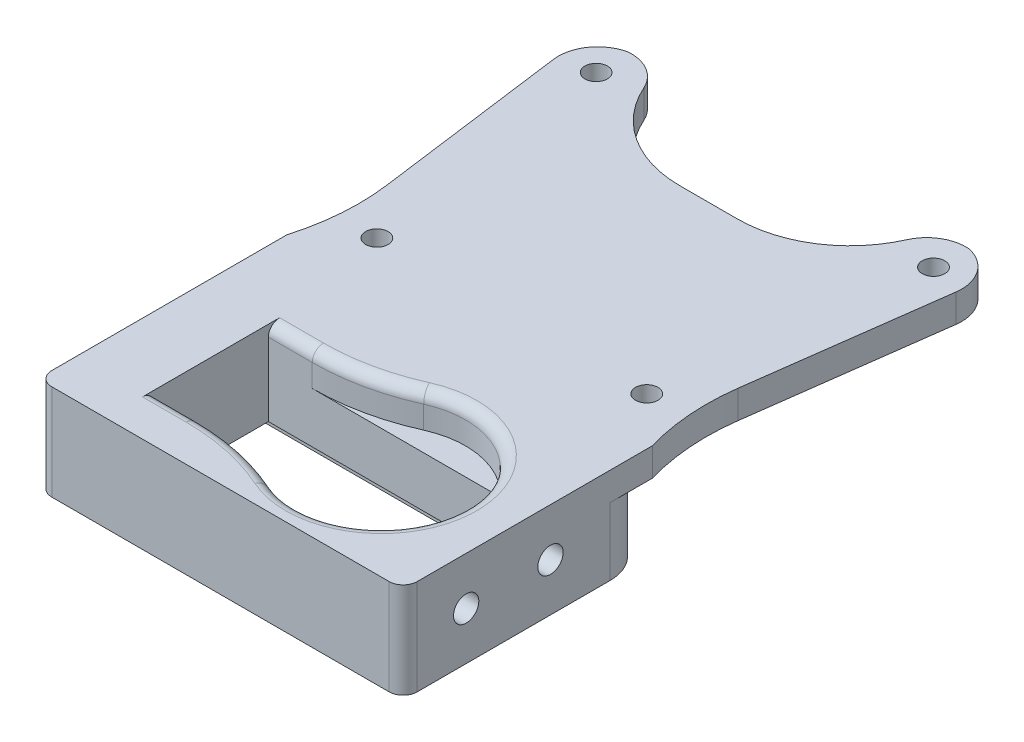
ISO-10303-21;
HEADER;
FILE_DESCRIPTION(('STEP AP214'),'2;1');
FILE_NAME('part.step','',(''),(''),'','','');
FILE_SCHEMA(('AUTOMOTIVE_DESIGN { 1 0 10303 214 1 1 1 1 }'));
ENDSEC;
DATA;
#1=APPLICATION_CONTEXT('core data for automotive mechanical design processes');
#2=APPLICATION_PROTOCOL_DEFINITION('international standard','automotive_design',2000,#1);
#3=PRODUCT_CONTEXT('',#1,'mechanical');
#4=PRODUCT('Part','Part','',(#3));
#5=PRODUCT_RELATED_PRODUCT_CATEGORY('part','',(#4));
#6=PRODUCT_DEFINITION_FORMATION('','',#4);
#7=PRODUCT_DEFINITION_CONTEXT('part definition',#1,'design');
#8=PRODUCT_DEFINITION('design','',#6,#7);
#9=PRODUCT_DEFINITION_SHAPE('','',#8);
#10=(LENGTH_UNIT() NAMED_UNIT(*) SI_UNIT(.MILLI.,.METRE.));
#11=(NAMED_UNIT(*) PLANE_ANGLE_UNIT() SI_UNIT($,.RADIAN.));
#12=(NAMED_UNIT(*) SI_UNIT($,.STERADIAN.) SOLID_ANGLE_UNIT());
#13=UNCERTAINTY_MEASURE_WITH_UNIT(LENGTH_MEASURE(1.E-05),#10,'distance_accuracy_value','');
#14=(GEOMETRIC_REPRESENTATION_CONTEXT(3) GLOBAL_UNCERTAINTY_ASSIGNED_CONTEXT((#13)) GLOBAL_UNIT_ASSIGNED_CONTEXT((#10,
#11,#12)) REPRESENTATION_CONTEXT('',''));
#15=CARTESIAN_POINT('',(0.,0.,0.));
#16=DIRECTION('',(0.,0.,1.));
#17=DIRECTION('',(1.,0.,0.));
#18=AXIS2_PLACEMENT_3D('',#15,#16,#17);
#19=CARTESIAN_POINT('',(0.,-10.,0.));
#20=DIRECTION('',(0.,1.,0.));
#21=DIRECTION('',(0.,0.,1.));
#22=AXIS2_PLACEMENT_3D('',#19,#20,#21);
#23=PLANE('',#22);
#24=CARTESIAN_POINT('',(24.40417131,-10.,50.6221554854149));
#25=DIRECTION('',(0.,1.,0.));
#26=DIRECTION('',(0.,0.,1.));
#27=AXIS2_PLACEMENT_3D('',#24,#25,#26);
#28=CIRCLE('',#27,2.25);
#29=CARTESIAN_POINT('',(24.40417131,-10.,52.8721554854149));
#30=VERTEX_POINT('',#29);
#31=EDGE_CURVE('E565',#30,#30,#28,.F.);
#32=ORIENTED_EDGE('',*,*,#31,.F.);
#33=EDGE_LOOP('',(#32));
#34=FACE_BOUND('',#33,.T.);
#35=CARTESIAN_POINT('',(-24.40417131,-10.,50.6221554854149));
#36=DIRECTION('',(0.,1.,0.));
#37=DIRECTION('',(0.,0.,1.));
#38=AXIS2_PLACEMENT_3D('',#35,#36,#37);
#39=CIRCLE('',#38,2.25);
#40=CARTESIAN_POINT('',(-24.40417131,-10.,52.8721554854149));
#41=VERTEX_POINT('',#40);
#42=EDGE_CURVE('E549',#41,#41,#39,.F.);
#43=ORIENTED_EDGE('',*,*,#42,.F.);
#44=EDGE_LOOP('',(#43));
#45=FACE_BOUND('',#44,.T.);
#46=DIRECTION('',(0.,0.,1.));
#47=VECTOR('',#46,1.);
#48=CARTESIAN_POINT('',(28.65,-10.,67.3221554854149));
#49=LINE('',#48,#47);
#50=CARTESIAN_POINT('',(28.65,-10.,43.9221554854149));
#51=VERTEX_POINT('',#50);
#52=CARTESIAN_POINT('',(28.65,-10.,53.8721554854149));
#53=VERTEX_POINT('',#52);
#54=EDGE_CURVE('E530',#51,#53,#49,.T.);
#55=ORIENTED_EDGE('',*,*,#54,.T.);
#56=DIRECTION('',(1.,0.,0.));
#57=VECTOR('',#56,1.);
#58=CARTESIAN_POINT('',(0.,-10.,53.8721554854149));
#59=LINE('',#58,#57);
#60=CARTESIAN_POINT('',(20.375,-10.,53.8721554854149));
#61=VERTEX_POINT('',#60);
#62=EDGE_CURVE('E1311',#53,#61,#59,.F.);
#63=ORIENTED_EDGE('',*,*,#62,.T.);
#64=DIRECTION('',(0.,0.,1.));
#65=VECTOR('',#64,1.);
#66=CARTESIAN_POINT('',(20.375,-10.,65.8221554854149));
#67=LINE('',#66,#65);
#68=CARTESIAN_POINT('',(20.375,-10.,45.4221554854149));
#69=VERTEX_POINT('',#68);
#70=EDGE_CURVE('E574',#69,#61,#67,.T.);
#71=ORIENTED_EDGE('',*,*,#70,.F.);
#72=DIRECTION('',(1.,0.,0.));
#73=VECTOR('',#72,1.);
#74=CARTESIAN_POINT('',(20.375,-10.,45.4221554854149));
#75=LINE('',#74,#73);
#76=CARTESIAN_POINT('',(-20.375,-10.,45.4221554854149));
#77=VERTEX_POINT('',#76);
#78=EDGE_CURVE('E578',#77,#69,#75,.T.);
#79=ORIENTED_EDGE('',*,*,#78,.F.);
#80=DIRECTION('',(0.,0.,-1.));
#81=VECTOR('',#80,1.);
#82=CARTESIAN_POINT('',(-20.375,-10.,65.8221554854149));
#83=LINE('',#82,#81);
#84=CARTESIAN_POINT('',(-20.375,-10.,53.8721554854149));
#85=VERTEX_POINT('',#84);
#86=EDGE_CURVE('E584',#85,#77,#83,.T.);
#87=ORIENTED_EDGE('',*,*,#86,.F.);
#88=DIRECTION('',(1.,0.,0.));
#89=VECTOR('',#88,1.);
#90=CARTESIAN_POINT('',(0.,-10.,53.8721554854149));
#91=LINE('',#90,#89);
#92=CARTESIAN_POINT('',(-28.65,-10.,53.8721554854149));
#93=VERTEX_POINT('',#92);
#94=EDGE_CURVE('E1306',#85,#93,#91,.F.);
#95=ORIENTED_EDGE('',*,*,#94,.T.);
#96=DIRECTION('',(0.,0.,-1.));
#97=VECTOR('',#96,1.);
#98=CARTESIAN_POINT('',(-28.65,-10.,67.3221554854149));
#99=LINE('',#98,#97);
#100=CARTESIAN_POINT('',(-28.65,-10.,43.9221554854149));
#101=VERTEX_POINT('',#100);
#102=EDGE_CURVE('E520',#93,#101,#99,.T.);
#103=ORIENTED_EDGE('',*,*,#102,.T.);
#104=DIRECTION('',(1.,0.,0.));
#105=VECTOR('',#104,1.);
#106=CARTESIAN_POINT('',(-28.65,-10.,43.9221554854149));
#107=LINE('',#106,#105);
#108=EDGE_CURVE('E524',#101,#51,#107,.T.);
#109=ORIENTED_EDGE('',*,*,#108,.T.);
#110=EDGE_LOOP('',(#55,#63,#71,#79,#87,#95,#103,#109));
#111=FACE_BOUND('',#110,.T.);
#112=ADVANCED_FACE('F50',(#34,#45,#111),#23,.F.);
#113=CARTESIAN_POINT('',(24.40417131,-10.,60.6221554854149));
#114=DIRECTION('',(0.,1.,0.));
#115=DIRECTION('',(0.,0.,1.));
#116=AXIS2_PLACEMENT_3D('',#113,#114,#115);
#117=CIRCLE('',#116,2.25);
#118=CARTESIAN_POINT('',(24.40417131,-10.,62.8721554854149));
#119=VERTEX_POINT('',#118);
#120=EDGE_CURVE('E556',#119,#119,#117,.F.);
#121=ORIENTED_EDGE('',*,*,#120,.F.);
#122=EDGE_LOOP('',(#121));
#123=FACE_BOUND('',#122,.T.);
#124=CARTESIAN_POINT('',(-24.40417131,-10.,60.6221554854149));
#125=DIRECTION('',(0.,1.,0.));
#126=DIRECTION('',(0.,0.,1.));
#127=AXIS2_PLACEMENT_3D('',#124,#125,#126);
#128=CIRCLE('',#127,2.25);
#129=CARTESIAN_POINT('',(-24.40417131,-10.,62.8721554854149));
#130=VERTEX_POINT('',#129);
#131=EDGE_CURVE('E566',#130,#130,#128,.F.);
#132=ORIENTED_EDGE('',*,*,#131,.F.);
#133=EDGE_LOOP('',(#132));
#134=FACE_BOUND('',#133,.T.);
#135=CARTESIAN_POINT('',(20.375,-10.,57.3721554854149));
#136=VERTEX_POINT('',#135);
#137=CARTESIAN_POINT('',(20.375,-10.,65.8221554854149));
#138=VERTEX_POINT('',#137);
#139=EDGE_CURVE('E572',#136,#138,#67,.T.);
#140=ORIENTED_EDGE('',*,*,#139,.F.);
#141=DIRECTION('',(-1.,0.,0.));
#142=VECTOR('',#141,1.);
#143=CARTESIAN_POINT('',(0.,-10.,57.3721554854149));
#144=LINE('',#143,#142);
#145=CARTESIAN_POINT('',(28.65,-10.,57.3721554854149));
#146=VERTEX_POINT('',#145);
#147=EDGE_CURVE('E1328',#136,#146,#144,.F.);
#148=ORIENTED_EDGE('',*,*,#147,.T.);
#149=CARTESIAN_POINT('',(28.65,-10.,67.3221554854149));
#150=VERTEX_POINT('',#149);
#151=EDGE_CURVE('E529',#146,#150,#49,.T.);
#152=ORIENTED_EDGE('',*,*,#151,.T.);
#153=DIRECTION('',(-1.,0.,0.));
#154=VECTOR('',#153,1.);
#155=CARTESIAN_POINT('',(-28.65,-10.,67.3221554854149));
#156=LINE('',#155,#154);
#157=CARTESIAN_POINT('',(-28.65,-10.,67.3221554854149));
#158=VERTEX_POINT('',#157);
#159=EDGE_CURVE('E514',#150,#158,#156,.T.);
#160=ORIENTED_EDGE('',*,*,#159,.T.);
#161=CARTESIAN_POINT('',(-28.65,-10.,57.3721554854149));
#162=VERTEX_POINT('',#161);
#163=EDGE_CURVE('E519',#158,#162,#99,.T.);
#164=ORIENTED_EDGE('',*,*,#163,.T.);
#165=DIRECTION('',(-1.,0.,0.));
#166=VECTOR('',#165,1.);
#167=CARTESIAN_POINT('',(0.,-10.,57.3721554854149));
#168=LINE('',#167,#166);
#169=CARTESIAN_POINT('',(-20.375,-10.,57.3721554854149));
#170=VERTEX_POINT('',#169);
#171=EDGE_CURVE('E1326',#162,#170,#168,.F.);
#172=ORIENTED_EDGE('',*,*,#171,.T.);
#173=CARTESIAN_POINT('',(-20.375,-10.,65.8221554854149));
#174=VERTEX_POINT('',#173);
#175=EDGE_CURVE('E581',#174,#170,#83,.T.);
#176=ORIENTED_EDGE('',*,*,#175,.F.);
#177=DIRECTION('',(-1.,0.,0.));
#178=VECTOR('',#177,1.);
#179=CARTESIAN_POINT('',(20.375,-10.,65.8221554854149));
#180=LINE('',#179,#178);
#181=EDGE_CURVE('E569',#138,#174,#180,.T.);
#182=ORIENTED_EDGE('',*,*,#181,.F.);
#183=EDGE_LOOP('',(#140,#148,#152,#160,#164,#172,#176,#182));
#184=FACE_BOUND('',#183,.T.);
#185=ADVANCED_FACE('F988',(#123,#134,#184),#23,.F.);
#186=CARTESIAN_POINT('',(0.,0.,0.));
#187=DIRECTION('',(0.,1.,0.));
#188=DIRECTION('',(0.,0.,1.));
#189=AXIS2_PLACEMENT_3D('',#186,#187,#188);
#190=PLANE('',#189);
#191=CARTESIAN_POINT('',(30.,0.,-22.5));
#192=DIRECTION('',(0.,1.,0.));
#193=DIRECTION('',(0.,0.,-1.));
#194=AXIS2_PLACEMENT_3D('',#191,#192,#193);
#195=CIRCLE('',#194,2.);
#196=CARTESIAN_POINT('',(30.,0.,-24.5));
#197=VERTEX_POINT('',#196);
#198=EDGE_CURVE('E670',#197,#197,#195,.T.);
#199=ORIENTED_EDGE('',*,*,#198,.T.);
#200=EDGE_LOOP('',(#199));
#201=FACE_BOUND('',#200,.T.);
#202=CARTESIAN_POINT('',(24.,0.,22.5));
#203=DIRECTION('',(0.,1.,0.));
#204=DIRECTION('',(0.,0.,-1.));
#205=AXIS2_PLACEMENT_3D('',#202,#203,#204);
#206=CIRCLE('',#205,2.);
#207=CARTESIAN_POINT('',(24.,0.,20.5));
#208=VERTEX_POINT('',#207);
#209=EDGE_CURVE('E667',#208,#208,#206,.T.);
#210=ORIENTED_EDGE('',*,*,#209,.T.);
#211=EDGE_LOOP('',(#210));
#212=FACE_BOUND('',#211,.T.);
#213=CARTESIAN_POINT('',(-24.,0.,22.5));
#214=DIRECTION('',(0.,1.,0.));
#215=DIRECTION('',(0.,0.,1.));
#216=AXIS2_PLACEMENT_3D('',#213,#214,#215);
#217=CIRCLE('',#216,2.);
#218=CARTESIAN_POINT('',(-24.,0.,24.5));
#219=VERTEX_POINT('',#218);
#220=EDGE_CURVE('E677',#219,#219,#217,.T.);
#221=ORIENTED_EDGE('',*,*,#220,.T.);
#222=EDGE_LOOP('',(#221));
#223=FACE_BOUND('',#222,.T.);
#224=CARTESIAN_POINT('',(-30.,0.,-22.5));
#225=DIRECTION('',(0.,1.,0.));
#226=DIRECTION('',(0.,0.,1.));
#227=AXIS2_PLACEMENT_3D('',#224,#225,#226);
#228=CIRCLE('',#227,2.);
#229=CARTESIAN_POINT('',(-30.,0.,-20.5));
#230=VERTEX_POINT('',#229);
#231=EDGE_CURVE('E684',#230,#230,#228,.T.);
#232=ORIENTED_EDGE('',*,*,#231,.T.);
#233=EDGE_LOOP('',(#232));
#234=FACE_BOUND('',#233,.T.);
#235=CARTESIAN_POINT('',(22.5,0.,20.));
#236=DIRECTION('',(0.,1.,0.));
#237=DIRECTION('',(0.,0.,1.));
#238=AXIS2_PLACEMENT_3D('',#235,#236,#237);
#239=CIRCLE('',#238,10.);
#240=CARTESIAN_POINT('',(22.5,0.,30.));
#241=VERTEX_POINT('',#240);
#242=CARTESIAN_POINT('',(12.5,0.,20.));
#243=VERTEX_POINT('',#242);
#244=EDGE_CURVE('E855',#241,#243,#239,.F.);
#245=ORIENTED_EDGE('',*,*,#244,.T.);
#246=CARTESIAN_POINT('',(42.3895146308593,0.,22.5723365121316));
#247=DIRECTION('',(0.,1.,0.));
#248=DIRECTION('',(0.,0.,1.));
#249=AXIS2_PLACEMENT_3D('',#246,#247,#248);
#250=CIRCLE('',#249,30.);
#251=CARTESIAN_POINT('',(18.3071991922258,0.,4.68261647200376));
#252=VERTEX_POINT('',#251);
#253=EDGE_CURVE('E1279',#243,#252,#250,.F.);
#254=ORIENTED_EDGE('',*,*,#253,.T.);
#255=DIRECTION('',(-0.596324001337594,0.,0.802743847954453));
#256=VECTOR('',#255,1.);
#257=CARTESIAN_POINT('',(12.5,0.,12.5));
#258=LINE('',#257,#256);
#259=CARTESIAN_POINT('',(25.5,0.,-5.00000000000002));
#260=VERTEX_POINT('',#259);
#261=EDGE_CURVE('E491',#260,#252,#258,.T.);
#262=ORIENTED_EDGE('',*,*,#261,.F.);
#263=DIRECTION('',(1.,0.,0.));
#264=VECTOR('',#263,1.);
#265=CARTESIAN_POINT('',(25.5,0.,-5.00000000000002));
#266=LINE('',#265,#264);
#267=CARTESIAN_POINT('',(-25.5,0.,-5.00000000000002));
#268=VERTEX_POINT('',#267);
#269=EDGE_CURVE('E490',#268,#260,#266,.T.);
#270=ORIENTED_EDGE('',*,*,#269,.F.);
#271=DIRECTION('',(-0.596324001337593,0.,-0.802743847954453));
#272=VECTOR('',#271,1.);
#273=CARTESIAN_POINT('',(-12.5,0.,12.5));
#274=LINE('',#273,#272);
#275=CARTESIAN_POINT('',(-18.3071991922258,0.,4.68261647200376));
#276=VERTEX_POINT('',#275);
#277=EDGE_CURVE('E450',#276,#268,#274,.T.);
#278=ORIENTED_EDGE('',*,*,#277,.F.);
#279=CARTESIAN_POINT('',(-42.3895146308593,0.,22.5723365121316));
#280=DIRECTION('',(0.,1.,0.));
#281=DIRECTION('',(0.,0.,1.));
#282=AXIS2_PLACEMENT_3D('',#279,#280,#281);
#283=CIRCLE('',#282,30.);
#284=CARTESIAN_POINT('',(-12.5,0.,20.));
#285=VERTEX_POINT('',#284);
#286=EDGE_CURVE('E1273',#276,#285,#283,.F.);
#287=ORIENTED_EDGE('',*,*,#286,.T.);
#288=CARTESIAN_POINT('',(-22.5,0.,20.));
#289=DIRECTION('',(0.,1.,0.));
#290=DIRECTION('',(0.,0.,1.));
#291=AXIS2_PLACEMENT_3D('',#288,#289,#290);
#292=CIRCLE('',#291,10.);
#293=CARTESIAN_POINT('',(-22.5,0.,30.));
#294=VERTEX_POINT('',#293);
#295=EDGE_CURVE('E857',#285,#294,#292,.F.);
#296=ORIENTED_EDGE('',*,*,#295,.T.);
#297=DIRECTION('',(-1.,0.,0.));
#298=VECTOR('',#297,1.);
#299=CARTESIAN_POINT('',(0.,0.,30.));
#300=LINE('',#299,#298);
#301=CARTESIAN_POINT('',(-25.,0.,30.));
#302=VERTEX_POINT('',#301);
#303=EDGE_CURVE('E653',#294,#302,#300,.T.);
#304=ORIENTED_EDGE('',*,*,#303,.T.);
#305=CARTESIAN_POINT('',(-25.,0.,37.5));
#306=DIRECTION('',(0.,1.,0.));
#307=DIRECTION('',(0.,0.,1.));
#308=AXIS2_PLACEMENT_3D('',#305,#306,#307);
#309=CIRCLE('',#308,7.5);
#310=CARTESIAN_POINT('',(-32.5,0.,37.5));
#311=VERTEX_POINT('',#310);
#312=EDGE_CURVE('E1268',#302,#311,#309,.T.);
#313=ORIENTED_EDGE('',*,*,#312,.T.);
#314=DIRECTION('',(0.,0.,1.));
#315=VECTOR('',#314,1.);
#316=CARTESIAN_POINT('',(-32.5,0.,0.));
#317=LINE('',#316,#315);
#318=CARTESIAN_POINT('',(-32.5,0.,30.));
#319=VERTEX_POINT('',#318);
#320=EDGE_CURVE('E1248',#319,#311,#317,.T.);
#321=ORIENTED_EDGE('',*,*,#320,.F.);
#322=CARTESIAN_POINT('',(-70.9002888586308,0.,18.8009904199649));
#323=DIRECTION('',(0.,1.,0.));
#324=DIRECTION('',(0.,0.,1.));
#325=AXIS2_PLACEMENT_3D('',#322,#323,#324);
#326=CIRCLE('',#325,40.);
#327=CARTESIAN_POINT('',(-31.2511728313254,0.,13.5144416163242));
#328=VERTEX_POINT('',#327);
#329=EDGE_CURVE('E806',#319,#328,#326,.T.);
#330=ORIENTED_EDGE('',*,*,#329,.T.);
#331=DIRECTION('',(0.132163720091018,0.,0.991227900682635));
#332=VECTOR('',#331,1.);
#333=CARTESIAN_POINT('',(-36.7403497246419,0.,-27.6543850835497));
#334=LINE('',#333,#332);
#335=CARTESIAN_POINT('',(-35.8152036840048,0.,-20.7157897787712));
#336=VERTEX_POINT('',#335);
#337=EDGE_CURVE('E695',#336,#328,#334,.T.);
#338=ORIENTED_EDGE('',*,*,#337,.F.);
#339=CARTESIAN_POINT('',(-28.8766083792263,0.,-21.6409358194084));
#340=DIRECTION('',(0.,1.,0.));
#341=DIRECTION('',(0.,0.,1.));
#342=AXIS2_PLACEMENT_3D('',#339,#340,#341);
#343=CIRCLE('',#342,7.);
#344=CARTESIAN_POINT('',(-30.2514033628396,0.,-28.5046038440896));
#345=VERTEX_POINT('',#344);
#346=EDGE_CURVE('E745',#336,#345,#343,.F.);
#347=ORIENTED_EDGE('',*,*,#346,.T.);
#348=CARTESIAN_POINT('',(-29.7798296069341,0.,-21.5205063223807));
#349=DIRECTION('',(0.,1.,0.));
#350=DIRECTION('',(0.,0.,1.));
#351=AXIS2_PLACEMENT_3D('',#348,#349,#350);
#352=CIRCLE('',#351,7.);
#353=CARTESIAN_POINT('',(-23.3847349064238,0.,-24.367041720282));
#354=VERTEX_POINT('',#353);
#355=EDGE_CURVE('E741',#345,#354,#352,.F.);
#356=ORIENTED_EDGE('',*,*,#355,.T.);
#357=CARTESIAN_POINT('',(-5.11303576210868,0.,-32.5));
#358=DIRECTION('',(0.,1.,0.));
#359=DIRECTION('',(0.,0.,1.));
#360=AXIS2_PLACEMENT_3D('',#357,#358,#359);
#361=CIRCLE('',#360,20.);
#362=CARTESIAN_POINT('',(-5.11303576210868,0.,-12.5));
#363=VERTEX_POINT('',#362);
#364=EDGE_CURVE('E732',#354,#363,#361,.T.);
#365=ORIENTED_EDGE('',*,*,#364,.T.);
#366=DIRECTION('',(-1.,0.,0.));
#367=VECTOR('',#366,1.);
#368=CARTESIAN_POINT('',(22.6135682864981,0.,-12.5));
#369=LINE('',#368,#367);
#370=CARTESIAN_POINT('',(5.11303576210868,0.,-12.5));
#371=VERTEX_POINT('',#370);
#372=EDGE_CURVE('E702',#371,#363,#369,.T.);
#373=ORIENTED_EDGE('',*,*,#372,.F.);
#374=CARTESIAN_POINT('',(5.11303576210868,0.,-32.5));
#375=DIRECTION('',(0.,1.,0.));
#376=DIRECTION('',(0.,0.,1.));
#377=AXIS2_PLACEMENT_3D('',#374,#375,#376);
#378=CIRCLE('',#377,20.);
#379=CARTESIAN_POINT('',(23.3847349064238,0.,-24.367041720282));
#380=VERTEX_POINT('',#379);
#381=EDGE_CURVE('E722',#371,#380,#378,.T.);
#382=ORIENTED_EDGE('',*,*,#381,.T.);
#383=CARTESIAN_POINT('',(29.7798296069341,0.,-21.5205063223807));
#384=DIRECTION('',(0.,1.,0.));
#385=DIRECTION('',(0.,0.,1.));
#386=AXIS2_PLACEMENT_3D('',#383,#384,#385);
#387=CIRCLE('',#386,7.);
#388=CARTESIAN_POINT('',(30.2514033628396,0.,-28.5046038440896));
#389=VERTEX_POINT('',#388);
#390=EDGE_CURVE('E754',#380,#389,#387,.F.);
#391=ORIENTED_EDGE('',*,*,#390,.T.);
#392=CARTESIAN_POINT('',(28.8766083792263,0.,-21.6409358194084));
#393=DIRECTION('',(0.,1.,0.));
#394=DIRECTION('',(0.,0.,1.));
#395=AXIS2_PLACEMENT_3D('',#392,#393,#394);
#396=CIRCLE('',#395,7.);
#397=CARTESIAN_POINT('',(35.8152036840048,0.,-20.7157897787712));
#398=VERTEX_POINT('',#397);
#399=EDGE_CURVE('E749',#389,#398,#396,.F.);
#400=ORIENTED_EDGE('',*,*,#399,.T.);
#401=DIRECTION('',(0.132163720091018,0.,-0.991227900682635));
#402=VECTOR('',#401,1.);
#403=CARTESIAN_POINT('',(36.7403497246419,0.,-27.6543850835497));
#404=LINE('',#403,#402);
#405=CARTESIAN_POINT('',(31.2511728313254,0.,13.5144416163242));
#406=VERTEX_POINT('',#405);
#407=EDGE_CURVE('E715',#406,#398,#404,.T.);
#408=ORIENTED_EDGE('',*,*,#407,.F.);
#409=CARTESIAN_POINT('',(70.9002888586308,0.,18.8009904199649));
#410=DIRECTION('',(0.,1.,0.));
#411=DIRECTION('',(0.,0.,1.));
#412=AXIS2_PLACEMENT_3D('',#409,#410,#411);
#413=CIRCLE('',#412,40.);
#414=CARTESIAN_POINT('',(32.5,0.,30.));
#415=VERTEX_POINT('',#414);
#416=EDGE_CURVE('E797',#406,#415,#413,.T.);
#417=ORIENTED_EDGE('',*,*,#416,.T.);
#418=DIRECTION('',(0.,0.,-1.));
#419=VECTOR('',#418,1.);
#420=CARTESIAN_POINT('',(32.5,0.,0.));
#421=LINE('',#420,#419);
#422=CARTESIAN_POINT('',(32.5,0.,37.5));
#423=VERTEX_POINT('',#422);
#424=EDGE_CURVE('E1259',#423,#415,#421,.T.);
#425=ORIENTED_EDGE('',*,*,#424,.F.);
#426=CARTESIAN_POINT('',(25.,0.,37.5));
#427=DIRECTION('',(0.,1.,0.));
#428=DIRECTION('',(0.,0.,1.));
#429=AXIS2_PLACEMENT_3D('',#426,#427,#428);
#430=CIRCLE('',#429,7.5);
#431=CARTESIAN_POINT('',(25.,0.,30.));
#432=VERTEX_POINT('',#431);
#433=EDGE_CURVE('E1271',#423,#432,#430,.T.);
#434=ORIENTED_EDGE('',*,*,#433,.T.);
#435=EDGE_CURVE('E659',#432,#241,#300,.T.);
#436=ORIENTED_EDGE('',*,*,#435,.T.);
#437=EDGE_LOOP('',(#245,#254,#262,#270,#278,#287,#296,#304,#313,#321,#330,#338,#347,#356,#365,
#373,#382,#391,#400,#408,#417,#425,#434,#436));
#438=FACE_BOUND('',#437,.T.);
#439=ADVANCED_FACE('F997',(#201,#212,#223,#234,#438),#190,.F.);
#440=CARTESIAN_POINT('',(32.5,-12.,30.));
#441=DIRECTION('',(0.,0.,-1.));
#442=DIRECTION('',(-1.,0.,0.));
#443=AXIS2_PLACEMENT_3D('',#440,#441,#442);
#444=PLANE('',#443);
#445=ORIENTED_EDGE('',*,*,#435,.F.);
#446=DIRECTION('',(0.,1.,0.));
#447=VECTOR('',#446,1.);
#448=CARTESIAN_POINT('',(25.,-12.,30.));
#449=LINE('',#448,#447);
#450=CARTESIAN_POINT('',(25.,-12.,30.));
#451=VERTEX_POINT('',#450);
#452=EDGE_CURVE('E1263',#432,#451,#449,.F.);
#453=ORIENTED_EDGE('',*,*,#452,.T.);
#454=DIRECTION('',(-1.,0.,0.));
#455=VECTOR('',#454,1.);
#456=CARTESIAN_POINT('',(32.5,-12.,30.));
#457=LINE('',#456,#455);
#458=CARTESIAN_POINT('',(22.5,-12.,30.));
#459=VERTEX_POINT('',#458);
#460=EDGE_CURVE('E640',#451,#459,#457,.T.);
#461=ORIENTED_EDGE('',*,*,#460,.T.);
#462=DIRECTION('',(0.,1.,0.));
#463=VECTOR('',#462,1.);
#464=CARTESIAN_POINT('',(22.5,-12.,30.));
#465=LINE('',#464,#463);
#466=EDGE_CURVE('E861',#459,#241,#465,.T.);
#467=ORIENTED_EDGE('',*,*,#466,.T.);
#468=EDGE_LOOP('',(#445,#453,#461,#467));
#469=FACE_BOUND('',#468,.T.);
#470=ADVANCED_FACE('F1062',(#469),#444,.T.);
#471=CARTESIAN_POINT('',(20.375,-12.,65.8221554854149));
#472=DIRECTION('',(1.,0.,0.));
#473=DIRECTION('',(0.,0.,-1.));
#474=AXIS2_PLACEMENT_3D('',#471,#472,#473);
#475=PLANE('',#474);
#476=ORIENTED_EDGE('',*,*,#70,.T.);
#477=CARTESIAN_POINT('',(20.375,-9.,53.8721554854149));
#478=DIRECTION('',(1.,0.,0.));
#479=DIRECTION('',(0.,0.,-1.));
#480=AXIS2_PLACEMENT_3D('',#477,#478,#479);
#481=CIRCLE('',#480,1.);
#482=CARTESIAN_POINT('',(20.375,-9.,54.8721554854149));
#483=VERTEX_POINT('',#482);
#484=EDGE_CURVE('E1317',#61,#483,#481,.F.);
#485=ORIENTED_EDGE('',*,*,#484,.T.);
#486=DIRECTION('',(0.,-1.,0.));
#487=VECTOR('',#486,1.);
#488=CARTESIAN_POINT('',(20.375,-8.,54.8721554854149));
#489=LINE('',#488,#487);
#490=CARTESIAN_POINT('',(20.375,-8.,54.8721554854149));
#491=VERTEX_POINT('',#490);
#492=EDGE_CURVE('E465',#491,#483,#489,.T.);
#493=ORIENTED_EDGE('',*,*,#492,.F.);
#494=DIRECTION('',(0.,0.,-1.));
#495=VECTOR('',#494,1.);
#496=CARTESIAN_POINT('',(20.375,-8.,54.8721554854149));
#497=LINE('',#496,#495);
#498=CARTESIAN_POINT('',(20.375,-8.,56.3721554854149));
#499=VERTEX_POINT('',#498);
#500=EDGE_CURVE('E440',#499,#491,#497,.T.);
#501=ORIENTED_EDGE('',*,*,#500,.F.);
#502=DIRECTION('',(0.,-1.,0.));
#503=VECTOR('',#502,1.);
#504=CARTESIAN_POINT('',(20.375,-8.,56.3721554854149));
#505=LINE('',#504,#503);
#506=CARTESIAN_POINT('',(20.375,-9.,56.3721554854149));
#507=VERTEX_POINT('',#506);
#508=EDGE_CURVE('E460',#499,#507,#505,.T.);
#509=ORIENTED_EDGE('',*,*,#508,.T.);
#510=CARTESIAN_POINT('',(20.375,-9.,57.3721554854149));
#511=DIRECTION('',(1.,0.,0.));
#512=DIRECTION('',(0.,0.,-1.));
#513=AXIS2_PLACEMENT_3D('',#510,#511,#512);
#514=CIRCLE('',#513,1.);
#515=EDGE_CURVE('E1316',#507,#136,#514,.F.);
#516=ORIENTED_EDGE('',*,*,#515,.T.);
#517=ORIENTED_EDGE('',*,*,#139,.T.);
#518=DIRECTION('',(0.,1.,0.));
#519=VECTOR('',#518,1.);
#520=CARTESIAN_POINT('',(20.375,-12.,65.8221554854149));
#521=LINE('',#520,#519);
#522=CARTESIAN_POINT('',(20.375,-1.,65.8221554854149));
#523=VERTEX_POINT('',#522);
#524=EDGE_CURVE('E620',#138,#523,#521,.T.);
#525=ORIENTED_EDGE('',*,*,#524,.T.);
#526=DIRECTION('',(0.,0.,1.));
#527=VECTOR('',#526,1.);
#528=CARTESIAN_POINT('',(20.375,-1.,65.8221554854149));
#529=LINE('',#528,#527);
#530=CARTESIAN_POINT('',(20.375,-1.,45.4221554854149));
#531=VERTEX_POINT('',#530);
#532=EDGE_CURVE('E507',#531,#523,#529,.T.);
#533=ORIENTED_EDGE('',*,*,#532,.F.);
#534=DIRECTION('',(0.,1.,0.));
#535=VECTOR('',#534,1.);
#536=CARTESIAN_POINT('',(20.375,-12.,45.4221554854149));
#537=LINE('',#536,#535);
#538=EDGE_CURVE('E614',#69,#531,#537,.T.);
#539=ORIENTED_EDGE('',*,*,#538,.F.);
#540=EDGE_LOOP('',(#476,#485,#493,#501,#509,#516,#517,#525,#533,#539));
#541=FACE_BOUND('',#540,.T.);
#542=ADVANCED_FACE('F1060',(#541),#475,.F.);
#543=CARTESIAN_POINT('',(0.,5.,0.));
#544=DIRECTION('',(0.,1.,0.));
#545=DIRECTION('',(0.,0.,1.));
#546=AXIS2_PLACEMENT_3D('',#543,#544,#545);
#547=PLANE('',#546);
#548=DIRECTION('',(1.,0.,0.));
#549=VECTOR('',#548,1.);
#550=CARTESIAN_POINT('',(-20.375,5.,67.8221554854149));
#551=LINE('',#550,#549);
#552=CARTESIAN_POINT('',(-12.575315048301,5.,67.8221554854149));
#553=VERTEX_POINT('',#552);
#554=CARTESIAN_POINT('',(-20.375,5.,67.8221554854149));
#555=VERTEX_POINT('',#554);
#556=EDGE_CURVE('E1368',#553,#555,#551,.F.);
#557=ORIENTED_EDGE('',*,*,#556,.T.);
#558=DIRECTION('',(0.,0.,1.));
#559=VECTOR('',#558,1.);
#560=CARTESIAN_POINT('',(-20.375,5.,65.8221554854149));
#561=LINE('',#560,#559);
#562=CARTESIAN_POINT('',(-20.375,5.,43.4221554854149));
#563=VERTEX_POINT('',#562);
#564=EDGE_CURVE('E601',#563,#555,#561,.T.);
#565=ORIENTED_EDGE('',*,*,#564,.F.);
#566=DIRECTION('',(-1.,0.,0.));
#567=VECTOR('',#566,1.);
#568=CARTESIAN_POINT('',(-12.575315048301,5.,43.4221554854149));
#569=LINE('',#568,#567);
#570=CARTESIAN_POINT('',(-12.575315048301,5.,43.4221554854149));
#571=VERTEX_POINT('',#570);
#572=EDGE_CURVE('E1372',#563,#571,#569,.F.);
#573=ORIENTED_EDGE('',*,*,#572,.T.);
#574=CARTESIAN_POINT('',(-12.575315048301,5.,5.42215548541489));
#575=DIRECTION('',(0.,1.,0.));
#576=DIRECTION('',(0.,0.,1.));
#577=AXIS2_PLACEMENT_3D('',#574,#575,#576);
#578=CIRCLE('',#577,38.);
#579=CARTESIAN_POINT('',(2.95032080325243,5.,40.1057918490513));
#580=VERTEX_POINT('',#579);
#581=EDGE_CURVE('E1358',#571,#580,#578,.T.);
#582=ORIENTED_EDGE('',*,*,#581,.T.);
#583=CARTESIAN_POINT('',(9.896,5.,55.6221554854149));
#584=DIRECTION('',(0.,1.,0.));
#585=DIRECTION('',(0.,0.,1.));
#586=AXIS2_PLACEMENT_3D('',#583,#584,#585);
#587=CIRCLE('',#586,17.);
#588=CARTESIAN_POINT('',(2.95032080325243,5.,71.1385191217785));
#589=VERTEX_POINT('',#588);
#590=EDGE_CURVE('E1184',#580,#589,#587,.F.);
#591=ORIENTED_EDGE('',*,*,#590,.T.);
#592=CARTESIAN_POINT('',(-12.575315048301,5.,105.822155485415));
#593=DIRECTION('',(0.,1.,0.));
#594=DIRECTION('',(0.,0.,1.));
#595=AXIS2_PLACEMENT_3D('',#592,#593,#594);
#596=CIRCLE('',#595,38.);
#597=EDGE_CURVE('E1363',#589,#553,#596,.T.);
#598=ORIENTED_EDGE('',*,*,#597,.T.);
#599=EDGE_LOOP('',(#557,#565,#573,#582,#591,#598));
#600=FACE_BOUND('',#599,.T.);
#601=DIRECTION('',(1.,0.,0.));
#602=VECTOR('',#601,1.);
#603=CARTESIAN_POINT('',(-32.5,5.,74.3221554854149));
#604=LINE('',#603,#602);
#605=CARTESIAN_POINT('',(-30.,5.,74.3221554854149));
#606=VERTEX_POINT('',#605);
#607=CARTESIAN_POINT('',(30.,5.,74.3221554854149));
#608=VERTEX_POINT('',#607);
#609=EDGE_CURVE('E642',#606,#608,#604,.T.);
#610=ORIENTED_EDGE('',*,*,#609,.T.);
#611=CARTESIAN_POINT('',(30.,5.,71.8221554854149));
#612=DIRECTION('',(0.,1.,0.));
#613=DIRECTION('',(0.,0.,1.));
#614=AXIS2_PLACEMENT_3D('',#611,#612,#613);
#615=CIRCLE('',#614,2.5);
#616=CARTESIAN_POINT('',(32.5,5.,71.8221554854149));
#617=VERTEX_POINT('',#616);
#618=EDGE_CURVE('E1223',#608,#617,#615,.T.);
#619=ORIENTED_EDGE('',*,*,#618,.T.);
#620=DIRECTION('',(0.,0.,-1.));
#621=VECTOR('',#620,1.);
#622=CARTESIAN_POINT('',(32.5,5.,74.3221554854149));
#623=LINE('',#622,#621);
#624=CARTESIAN_POINT('',(32.5,5.,30.));
#625=VERTEX_POINT('',#624);
#626=EDGE_CURVE('E630',#617,#625,#623,.T.);
#627=ORIENTED_EDGE('',*,*,#626,.T.);
#628=CARTESIAN_POINT('',(70.9002888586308,5.,18.8009904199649));
#629=DIRECTION('',(0.,1.,0.));
#630=DIRECTION('',(0.,0.,1.));
#631=AXIS2_PLACEMENT_3D('',#628,#629,#630);
#632=CIRCLE('',#631,40.);
#633=CARTESIAN_POINT('',(31.2511728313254,5.,13.5144416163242));
#634=VERTEX_POINT('',#633);
#635=EDGE_CURVE('E802',#625,#634,#632,.F.);
#636=ORIENTED_EDGE('',*,*,#635,.T.);
#637=DIRECTION('',(0.132163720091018,0.,-0.991227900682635));
#638=VECTOR('',#637,1.);
#639=CARTESIAN_POINT('',(36.7403497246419,5.,-27.6543850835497));
#640=LINE('',#639,#638);
#641=CARTESIAN_POINT('',(35.8152036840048,5.,-20.7157897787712));
#642=VERTEX_POINT('',#641);
#643=EDGE_CURVE('E700',#634,#642,#640,.T.);
#644=ORIENTED_EDGE('',*,*,#643,.T.);
#645=CARTESIAN_POINT('',(28.8766083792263,5.,-21.6409358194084));
#646=DIRECTION('',(0.,1.,0.));
#647=DIRECTION('',(0.,0.,1.));
#648=AXIS2_PLACEMENT_3D('',#645,#646,#647);
#649=CIRCLE('',#648,7.);
#650=CARTESIAN_POINT('',(30.2514033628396,5.,-28.5046038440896));
#651=VERTEX_POINT('',#650);
#652=EDGE_CURVE('E762',#642,#651,#649,.T.);
#653=ORIENTED_EDGE('',*,*,#652,.T.);
#654=CARTESIAN_POINT('',(29.7798296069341,5.,-21.5205063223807));
#655=DIRECTION('',(0.,1.,0.));
#656=DIRECTION('',(0.,0.,1.));
#657=AXIS2_PLACEMENT_3D('',#654,#655,#656);
#658=CIRCLE('',#657,7.);
#659=CARTESIAN_POINT('',(23.3847349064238,5.,-24.367041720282));
#660=VERTEX_POINT('',#659);
#661=EDGE_CURVE('E761',#651,#660,#658,.T.);
#662=ORIENTED_EDGE('',*,*,#661,.T.);
#663=CARTESIAN_POINT('',(5.11303576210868,5.,-32.5));
#664=DIRECTION('',(0.,1.,0.));
#665=DIRECTION('',(0.,0.,1.));
#666=AXIS2_PLACEMENT_3D('',#663,#664,#665);
#667=CIRCLE('',#666,20.);
#668=CARTESIAN_POINT('',(5.11303576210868,5.,-12.5));
#669=VERTEX_POINT('',#668);
#670=EDGE_CURVE('E727',#660,#669,#667,.F.);
#671=ORIENTED_EDGE('',*,*,#670,.T.);
#672=DIRECTION('',(-1.,0.,0.));
#673=VECTOR('',#672,1.);
#674=CARTESIAN_POINT('',(22.6135682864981,5.,-12.5));
#675=LINE('',#674,#673);
#676=CARTESIAN_POINT('',(-5.11303576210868,5.,-12.5));
#677=VERTEX_POINT('',#676);
#678=EDGE_CURVE('E701',#669,#677,#675,.T.);
#679=ORIENTED_EDGE('',*,*,#678,.T.);
#680=CARTESIAN_POINT('',(-5.11303576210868,5.,-32.5));
#681=DIRECTION('',(0.,1.,0.));
#682=DIRECTION('',(0.,0.,1.));
#683=AXIS2_PLACEMENT_3D('',#680,#681,#682);
#684=CIRCLE('',#683,20.);
#685=CARTESIAN_POINT('',(-23.3847349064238,5.,-24.367041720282));
#686=VERTEX_POINT('',#685);
#687=EDGE_CURVE('E731',#677,#686,#684,.F.);
#688=ORIENTED_EDGE('',*,*,#687,.T.);
#689=CARTESIAN_POINT('',(-29.7798296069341,5.,-21.5205063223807));
#690=DIRECTION('',(0.,1.,0.));
#691=DIRECTION('',(0.,0.,1.));
#692=AXIS2_PLACEMENT_3D('',#689,#690,#691);
#693=CIRCLE('',#692,7.);
#694=CARTESIAN_POINT('',(-30.2514033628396,5.,-28.5046038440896));
#695=VERTEX_POINT('',#694);
#696=EDGE_CURVE('E756',#686,#695,#693,.T.);
#697=ORIENTED_EDGE('',*,*,#696,.T.);
#698=CARTESIAN_POINT('',(-28.8766083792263,5.,-21.6409358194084));
#699=DIRECTION('',(0.,1.,0.));
#700=DIRECTION('',(0.,0.,1.));
#701=AXIS2_PLACEMENT_3D('',#698,#699,#700);
#702=CIRCLE('',#701,7.);
#703=CARTESIAN_POINT('',(-35.8152036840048,5.,-20.7157897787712));
#704=VERTEX_POINT('',#703);
#705=EDGE_CURVE('E753',#695,#704,#702,.T.);
#706=ORIENTED_EDGE('',*,*,#705,.T.);
#707=DIRECTION('',(0.132163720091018,0.,0.991227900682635));
#708=VECTOR('',#707,1.);
#709=CARTESIAN_POINT('',(-36.7403497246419,5.,-27.6543850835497));
#710=LINE('',#709,#708);
#711=CARTESIAN_POINT('',(-31.2511728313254,5.,13.5144416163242));
#712=VERTEX_POINT('',#711);
#713=EDGE_CURVE('E696',#704,#712,#710,.T.);
#714=ORIENTED_EDGE('',*,*,#713,.T.);
#715=CARTESIAN_POINT('',(-70.9002888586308,5.,18.8009904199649));
#716=DIRECTION('',(0.,1.,0.));
#717=DIRECTION('',(0.,0.,1.));
#718=AXIS2_PLACEMENT_3D('',#715,#716,#717);
#719=CIRCLE('',#718,40.);
#720=CARTESIAN_POINT('',(-32.5,5.,30.));
#721=VERTEX_POINT('',#720);
#722=EDGE_CURVE('E807',#712,#721,#719,.F.);
#723=ORIENTED_EDGE('',*,*,#722,.T.);
#724=DIRECTION('',(0.,0.,1.));
#725=VECTOR('',#724,1.);
#726=CARTESIAN_POINT('',(-32.5,5.,30.));
#727=LINE('',#726,#725);
#728=CARTESIAN_POINT('',(-32.5,5.,71.8221554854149));
#729=VERTEX_POINT('',#728);
#730=EDGE_CURVE('E615',#721,#729,#727,.T.);
#731=ORIENTED_EDGE('',*,*,#730,.T.);
#732=CARTESIAN_POINT('',(-30.,5.,71.8221554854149));
#733=DIRECTION('',(0.,1.,0.));
#734=DIRECTION('',(0.,0.,1.));
#735=AXIS2_PLACEMENT_3D('',#732,#733,#734);
#736=CIRCLE('',#735,2.5);
#737=EDGE_CURVE('E1221',#729,#606,#736,.T.);
#738=ORIENTED_EDGE('',*,*,#737,.T.);
#739=EDGE_LOOP('',(#610,#619,#627,#636,#644,#653,#662,#671,#679,#688,#697,#706,#714,#723,#731,#738));
#740=FACE_BOUND('',#739,.T.);
#741=CARTESIAN_POINT('',(24.,5.,22.5));
#742=DIRECTION('',(0.,1.,0.));
#743=DIRECTION('',(0.,0.,-1.));
#744=AXIS2_PLACEMENT_3D('',#741,#742,#743);
#745=CIRCLE('',#744,2.);
#746=CARTESIAN_POINT('',(24.,5.,20.5));
#747=VERTEX_POINT('',#746);
#748=EDGE_CURVE('E672',#747,#747,#745,.T.);
#749=ORIENTED_EDGE('',*,*,#748,.F.);
#750=EDGE_LOOP('',(#749));
#751=FACE_BOUND('',#750,.T.);
#752=CARTESIAN_POINT('',(-30.,5.,-22.5));
#753=DIRECTION('',(0.,1.,0.));
#754=DIRECTION('',(0.,0.,1.));
#755=AXIS2_PLACEMENT_3D('',#752,#753,#754);
#756=CIRCLE('',#755,2.);
#757=CARTESIAN_POINT('',(-30.,5.,-20.5));
#758=VERTEX_POINT('',#757);
#759=EDGE_CURVE('E689',#758,#758,#756,.T.);
#760=ORIENTED_EDGE('',*,*,#759,.F.);
#761=EDGE_LOOP('',(#760));
#762=FACE_BOUND('',#761,.T.);
#763=CARTESIAN_POINT('',(-24.,5.,22.5));
#764=DIRECTION('',(0.,1.,0.));
#765=DIRECTION('',(0.,0.,1.));
#766=AXIS2_PLACEMENT_3D('',#763,#764,#765);
#767=CIRCLE('',#766,2.);
#768=CARTESIAN_POINT('',(-24.,5.,24.5));
#769=VERTEX_POINT('',#768);
#770=EDGE_CURVE('E678',#769,#769,#767,.T.);
#771=ORIENTED_EDGE('',*,*,#770,.F.);
#772=EDGE_LOOP('',(#771));
#773=FACE_BOUND('',#772,.T.);
#774=CARTESIAN_POINT('',(30.,5.,-22.5));
#775=DIRECTION('',(0.,1.,0.));
#776=DIRECTION('',(0.,0.,-1.));
#777=AXIS2_PLACEMENT_3D('',#774,#775,#776);
#778=CIRCLE('',#777,2.);
#779=CARTESIAN_POINT('',(30.,5.,-24.5));
#780=VERTEX_POINT('',#779);
#781=EDGE_CURVE('E665',#780,#780,#778,.T.);
#782=ORIENTED_EDGE('',*,*,#781,.F.);
#783=EDGE_LOOP('',(#782));
#784=FACE_BOUND('',#783,.T.);
#785=ADVANCED_FACE('F1058',(#600,#740,#751,#762,#773,#784),#547,.T.);
#786=CARTESIAN_POINT('',(-36.7403497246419,5.,-27.6543850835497));
#787=DIRECTION('',(0.991227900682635,0.,-0.132163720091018));
#788=DIRECTION('',(-0.132163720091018,0.,-0.991227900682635));
#789=AXIS2_PLACEMENT_3D('',#786,#787,#788);
#790=PLANE('',#789);
#791=ORIENTED_EDGE('',*,*,#337,.T.);
#792=DIRECTION('',(0.,1.,0.));
#793=VECTOR('',#792,1.);
#794=CARTESIAN_POINT('',(-31.2511728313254,5.,13.5144416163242));
#795=LINE('',#794,#793);
#796=EDGE_CURVE('E794',#328,#712,#795,.T.);
#797=ORIENTED_EDGE('',*,*,#796,.T.);
#798=ORIENTED_EDGE('',*,*,#713,.F.);
#799=DIRECTION('',(0.,-1.,0.));
#800=VECTOR('',#799,1.);
#801=CARTESIAN_POINT('',(-35.8152036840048,5.,-20.7157897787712));
#802=LINE('',#801,#800);
#803=EDGE_CURVE('E775',#704,#336,#802,.T.);
#804=ORIENTED_EDGE('',*,*,#803,.T.);
#805=EDGE_LOOP('',(#791,#797,#798,#804));
#806=FACE_BOUND('',#805,.T.);
#807=ADVANCED_FACE('F1108',(#806),#790,.F.);
#808=CARTESIAN_POINT('',(36.7403497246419,5.,-27.6543850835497));
#809=DIRECTION('',(-0.991227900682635,0.,-0.132163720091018));
#810=DIRECTION('',(-0.132163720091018,0.,0.991227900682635));
#811=AXIS2_PLACEMENT_3D('',#808,#809,#810);
#812=PLANE('',#811);
#813=ORIENTED_EDGE('',*,*,#643,.F.);
#814=DIRECTION('',(0.,-1.,0.));
#815=VECTOR('',#814,1.);
#816=CARTESIAN_POINT('',(31.2511728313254,5.,13.5144416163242));
#817=LINE('',#816,#815);
#818=EDGE_CURVE('E791',#634,#406,#817,.T.);
#819=ORIENTED_EDGE('',*,*,#818,.T.);
#820=ORIENTED_EDGE('',*,*,#407,.T.);
#821=DIRECTION('',(0.,-1.,0.));
#822=VECTOR('',#821,1.);
#823=CARTESIAN_POINT('',(35.8152036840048,5.,-20.7157897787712));
#824=LINE('',#823,#822);
#825=EDGE_CURVE('E771',#398,#642,#824,.F.);
#826=ORIENTED_EDGE('',*,*,#825,.T.);
#827=EDGE_LOOP('',(#813,#819,#820,#826));
#828=FACE_BOUND('',#827,.T.);
#829=ADVANCED_FACE('F1120',(#828),#812,.F.);
#830=CARTESIAN_POINT('',(22.6135682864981,5.,-12.5));
#831=DIRECTION('',(0.,0.,1.));
#832=DIRECTION('',(1.,0.,0.));
#833=AXIS2_PLACEMENT_3D('',#830,#831,#832);
#834=PLANE('',#833);
#835=ORIENTED_EDGE('',*,*,#678,.F.);
#836=DIRECTION('',(0.,-1.,0.));
#837=VECTOR('',#836,1.);
#838=CARTESIAN_POINT('',(5.11303576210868,5.,-12.5));
#839=LINE('',#838,#837);
#840=EDGE_CURVE('E719',#669,#371,#839,.T.);
#841=ORIENTED_EDGE('',*,*,#840,.T.);
#842=ORIENTED_EDGE('',*,*,#372,.T.);
#843=DIRECTION('',(0.,1.,0.));
#844=VECTOR('',#843,1.);
#845=CARTESIAN_POINT('',(-5.11303576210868,5.,-12.5));
#846=LINE('',#845,#844);
#847=EDGE_CURVE('E706',#363,#677,#846,.T.);
#848=ORIENTED_EDGE('',*,*,#847,.T.);
#849=EDGE_LOOP('',(#835,#841,#842,#848));
#850=FACE_BOUND('',#849,.T.);
#851=ADVANCED_FACE('F1107',(#850),#834,.F.);
#852=CARTESIAN_POINT('',(-30.,5.,-22.5));
#853=DIRECTION('',(0.,-1.,0.));
#854=DIRECTION('',(0.,0.,-1.));
#855=AXIS2_PLACEMENT_3D('',#852,#853,#854);
#856=CYLINDRICAL_SURFACE('',#855,2.);
#857=ORIENTED_EDGE('',*,*,#759,.T.);
#858=EDGE_LOOP('',(#857));
#859=FACE_BOUND('',#858,.T.);
#860=ORIENTED_EDGE('',*,*,#231,.F.);
#861=EDGE_LOOP('',(#860));
#862=FACE_BOUND('',#861,.T.);
#863=ADVANCED_FACE('F1105',(#859,#862),#856,.F.);
#864=CARTESIAN_POINT('',(-24.,5.,22.5));
#865=DIRECTION('',(0.,-1.,0.));
#866=DIRECTION('',(0.,0.,-1.));
#867=AXIS2_PLACEMENT_3D('',#864,#865,#866);
#868=CYLINDRICAL_SURFACE('',#867,2.);
#869=ORIENTED_EDGE('',*,*,#770,.T.);
#870=EDGE_LOOP('',(#869));
#871=FACE_BOUND('',#870,.T.);
#872=ORIENTED_EDGE('',*,*,#220,.F.);
#873=EDGE_LOOP('',(#872));
#874=FACE_BOUND('',#873,.T.);
#875=ADVANCED_FACE('F1098',(#871,#874),#868,.F.);
#876=CARTESIAN_POINT('',(24.,5.,22.5));
#877=DIRECTION('',(0.,-1.,0.));
#878=DIRECTION('',(0.,0.,-1.));
#879=AXIS2_PLACEMENT_3D('',#876,#877,#878);
#880=CYLINDRICAL_SURFACE('',#879,2.);
#881=ORIENTED_EDGE('',*,*,#748,.T.);
#882=EDGE_LOOP('',(#881));
#883=FACE_BOUND('',#882,.T.);
#884=ORIENTED_EDGE('',*,*,#209,.F.);
#885=EDGE_LOOP('',(#884));
#886=FACE_BOUND('',#885,.T.);
#887=ADVANCED_FACE('F1092',(#883,#886),#880,.F.);
#888=CARTESIAN_POINT('',(30.,5.,-22.5));
#889=DIRECTION('',(0.,-1.,0.));
#890=DIRECTION('',(0.,0.,-1.));
#891=AXIS2_PLACEMENT_3D('',#888,#889,#890);
#892=CYLINDRICAL_SURFACE('',#891,2.);
#893=ORIENTED_EDGE('',*,*,#781,.T.);
#894=EDGE_LOOP('',(#893));
#895=FACE_BOUND('',#894,.T.);
#896=ORIENTED_EDGE('',*,*,#198,.F.);
#897=EDGE_LOOP('',(#896));
#898=FACE_BOUND('',#897,.T.);
#899=ADVANCED_FACE('F1087',(#895,#898),#892,.F.);
#900=CARTESIAN_POINT('',(5.11303576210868,5.,-32.5));
#901=DIRECTION('',(0.,-1.,0.));
#902=DIRECTION('',(0.,0.,-1.));
#903=AXIS2_PLACEMENT_3D('',#900,#901,#902);
#904=CYLINDRICAL_SURFACE('',#903,20.);
#905=ORIENTED_EDGE('',*,*,#670,.F.);
#906=DIRECTION('',(0.,-1.,0.));
#907=VECTOR('',#906,1.);
#908=CARTESIAN_POINT('',(23.3847349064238,5.,-24.367041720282));
#909=LINE('',#908,#907);
#910=EDGE_CURVE('E739',#660,#380,#909,.T.);
#911=ORIENTED_EDGE('',*,*,#910,.T.);
#912=ORIENTED_EDGE('',*,*,#381,.F.);
#913=ORIENTED_EDGE('',*,*,#840,.F.);
#914=EDGE_LOOP('',(#905,#911,#912,#913));
#915=FACE_BOUND('',#914,.T.);
#916=ADVANCED_FACE('F1093',(#915),#904,.F.);
#917=CARTESIAN_POINT('',(-5.11303576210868,5.,-32.5));
#918=DIRECTION('',(0.,1.,0.));
#919=DIRECTION('',(0.,0.,1.));
#920=AXIS2_PLACEMENT_3D('',#917,#918,#919);
#921=CYLINDRICAL_SURFACE('',#920,20.);
#922=ORIENTED_EDGE('',*,*,#364,.F.);
#923=DIRECTION('',(0.,1.,0.));
#924=VECTOR('',#923,1.);
#925=CARTESIAN_POINT('',(-23.3847349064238,5.,-24.367041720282));
#926=LINE('',#925,#924);
#927=EDGE_CURVE('E770',#354,#686,#926,.T.);
#928=ORIENTED_EDGE('',*,*,#927,.T.);
#929=ORIENTED_EDGE('',*,*,#687,.F.);
#930=ORIENTED_EDGE('',*,*,#847,.F.);
#931=EDGE_LOOP('',(#922,#928,#929,#930));
#932=FACE_BOUND('',#931,.T.);
#933=ADVANCED_FACE('F1129',(#932),#921,.F.);
#934=CARTESIAN_POINT('',(28.8766083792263,5.,-21.6409358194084));
#935=DIRECTION('',(0.,-1.,0.));
#936=DIRECTION('',(0.,0.,-1.));
#937=AXIS2_PLACEMENT_3D('',#934,#935,#936);
#938=CYLINDRICAL_SURFACE('',#937,7.);
#939=DIRECTION('',(0.,-1.,0.));
#940=VECTOR('',#939,1.);
#941=CARTESIAN_POINT('',(30.2514033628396,2.5,-28.5046038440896));
#942=LINE('',#941,#940);
#943=EDGE_CURVE('E671',#651,#389,#942,.T.);
#944=ORIENTED_EDGE('',*,*,#943,.F.);
#945=ORIENTED_EDGE('',*,*,#652,.F.);
#946=ORIENTED_EDGE('',*,*,#825,.F.);
#947=ORIENTED_EDGE('',*,*,#399,.F.);
#948=EDGE_LOOP('',(#944,#945,#946,#947));
#949=FACE_BOUND('',#948,.T.);
#950=ADVANCED_FACE('F1132',(#949),#938,.T.);
#951=CARTESIAN_POINT('',(29.7798296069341,5.,-21.5205063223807));
#952=DIRECTION('',(0.,-1.,0.));
#953=DIRECTION('',(0.,0.,-1.));
#954=AXIS2_PLACEMENT_3D('',#951,#952,#953);
#955=CYLINDRICAL_SURFACE('',#954,7.);
#956=ORIENTED_EDGE('',*,*,#661,.F.);
#957=ORIENTED_EDGE('',*,*,#943,.T.);
#958=ORIENTED_EDGE('',*,*,#390,.F.);
#959=ORIENTED_EDGE('',*,*,#910,.F.);
#960=EDGE_LOOP('',(#956,#957,#958,#959));
#961=FACE_BOUND('',#960,.T.);
#962=ADVANCED_FACE('F1131',(#961),#955,.T.);
#963=CARTESIAN_POINT('',(-28.8766083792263,5.,-21.6409358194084));
#964=DIRECTION('',(0.,-1.,0.));
#965=DIRECTION('',(0.,0.,-1.));
#966=AXIS2_PLACEMENT_3D('',#963,#964,#965);
#967=CYLINDRICAL_SURFACE('',#966,7.);
#968=ORIENTED_EDGE('',*,*,#803,.F.);
#969=ORIENTED_EDGE('',*,*,#705,.F.);
#970=DIRECTION('',(0.,-1.,0.));
#971=VECTOR('',#970,1.);
#972=CARTESIAN_POINT('',(-30.2514033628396,2.5,-28.5046038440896));
#973=LINE('',#972,#971);
#974=EDGE_CURVE('E662',#345,#695,#973,.F.);
#975=ORIENTED_EDGE('',*,*,#974,.F.);
#976=ORIENTED_EDGE('',*,*,#346,.F.);
#977=EDGE_LOOP('',(#968,#969,#975,#976));
#978=FACE_BOUND('',#977,.T.);
#979=ADVANCED_FACE('F1137',(#978),#967,.T.);
#980=CARTESIAN_POINT('',(-29.7798296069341,5.,-21.5205063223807));
#981=DIRECTION('',(0.,1.,0.));
#982=DIRECTION('',(0.,0.,1.));
#983=AXIS2_PLACEMENT_3D('',#980,#981,#982);
#984=CYLINDRICAL_SURFACE('',#983,7.);
#985=ORIENTED_EDGE('',*,*,#696,.F.);
#986=ORIENTED_EDGE('',*,*,#927,.F.);
#987=ORIENTED_EDGE('',*,*,#355,.F.);
#988=ORIENTED_EDGE('',*,*,#974,.T.);
#989=EDGE_LOOP('',(#985,#986,#987,#988));
#990=FACE_BOUND('',#989,.T.);
#991=ADVANCED_FACE('F1080',(#990),#984,.T.);
#992=CARTESIAN_POINT('',(-22.5,-12.,30.));
#993=VERTEX_POINT('',#992);
#994=CARTESIAN_POINT('',(-25.,-12.,30.));
#995=VERTEX_POINT('',#994);
#996=EDGE_CURVE('E638',#993,#995,#457,.T.);
#997=ORIENTED_EDGE('',*,*,#996,.T.);
#998=DIRECTION('',(0.,1.,0.));
#999=VECTOR('',#998,1.);
#1000=CARTESIAN_POINT('',(-25.,-12.,30.));
#1001=LINE('',#1000,#999);
#1002=EDGE_CURVE('E1241',#995,#302,#1001,.T.);
#1003=ORIENTED_EDGE('',*,*,#1002,.T.);
#1004=ORIENTED_EDGE('',*,*,#303,.F.);
#1005=DIRECTION('',(0.,1.,0.));
#1006=VECTOR('',#1005,1.);
#1007=CARTESIAN_POINT('',(-22.5,-12.,30.));
#1008=LINE('',#1007,#1006);
#1009=EDGE_CURVE('E859',#294,#993,#1008,.F.);
#1010=ORIENTED_EDGE('',*,*,#1009,.T.);
#1011=EDGE_LOOP('',(#997,#1003,#1004,#1010));
#1012=FACE_BOUND('',#1011,.T.);
#1013=ADVANCED_FACE('F1073',(#1012),#444,.T.);
#1014=CARTESIAN_POINT('',(-32.5,-12.,30.));
#1015=DIRECTION('',(-1.,0.,0.));
#1016=DIRECTION('',(0.,0.,1.));
#1017=AXIS2_PLACEMENT_3D('',#1014,#1015,#1016);
#1018=PLANE('',#1017);
#1019=CARTESIAN_POINT('',(-32.5,-3.5,48.1221554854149));
#1020=DIRECTION('',(-1.,0.,0.));
#1021=DIRECTION('',(0.,0.,1.));
#1022=AXIS2_PLACEMENT_3D('',#1019,#1020,#1021);
#1023=CIRCLE('',#1022,2.25);
#1024=CARTESIAN_POINT('',(-32.5,-3.5,50.3721554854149));
#1025=VERTEX_POINT('',#1024);
#1026=EDGE_CURVE('E2104',#1025,#1025,#1023,.T.);
#1027=ORIENTED_EDGE('',*,*,#1026,.F.);
#1028=EDGE_LOOP('',(#1027));
#1029=FACE_BOUND('',#1028,.T.);
#1030=CARTESIAN_POINT('',(-32.5,-3.5,63.1221554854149));
#1031=DIRECTION('',(-1.,0.,0.));
#1032=DIRECTION('',(0.,0.,-1.));
#1033=AXIS2_PLACEMENT_3D('',#1030,#1031,#1032);
#1034=CIRCLE('',#1033,2.25);
#1035=CARTESIAN_POINT('',(-32.5,-3.5,60.8721554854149));
#1036=VERTEX_POINT('',#1035);
#1037=EDGE_CURVE('E2090',#1036,#1036,#1034,.T.);
#1038=ORIENTED_EDGE('',*,*,#1037,.F.);
#1039=EDGE_LOOP('',(#1038));
#1040=FACE_BOUND('',#1039,.T.);
#1041=DIRECTION('',(0.,1.,0.));
#1042=VECTOR('',#1041,1.);
#1043=CARTESIAN_POINT('',(-32.5,-12.,30.));
#1044=LINE('',#1043,#1042);
#1045=EDGE_CURVE('E649',#319,#721,#1044,.T.);
#1046=ORIENTED_EDGE('',*,*,#1045,.F.);
#1047=ORIENTED_EDGE('',*,*,#320,.T.);
#1048=DIRECTION('',(0.,1.,0.));
#1049=VECTOR('',#1048,1.);
#1050=CARTESIAN_POINT('',(-32.5,-12.,37.5));
#1051=LINE('',#1050,#1049);
#1052=CARTESIAN_POINT('',(-32.5,-12.,37.5));
#1053=VERTEX_POINT('',#1052);
#1054=EDGE_CURVE('E1244',#311,#1053,#1051,.F.);
#1055=ORIENTED_EDGE('',*,*,#1054,.T.);
#1056=DIRECTION('',(0.,0.,1.));
#1057=VECTOR('',#1056,1.);
#1058=CARTESIAN_POINT('',(-32.5,-12.,30.));
#1059=LINE('',#1058,#1057);
#1060=CARTESIAN_POINT('',(-32.5,-12.,71.8221554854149));
#1061=VERTEX_POINT('',#1060);
#1062=EDGE_CURVE('E623',#1053,#1061,#1059,.T.);
#1063=ORIENTED_EDGE('',*,*,#1062,.T.);
#1064=DIRECTION('',(0.,1.,0.));
#1065=VECTOR('',#1064,1.);
#1066=CARTESIAN_POINT('',(-32.5,-12.,71.8221554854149));
#1067=LINE('',#1066,#1065);
#1068=EDGE_CURVE('E1240',#1061,#729,#1067,.T.);
#1069=ORIENTED_EDGE('',*,*,#1068,.T.);
#1070=ORIENTED_EDGE('',*,*,#730,.F.);
#1071=EDGE_LOOP('',(#1046,#1047,#1055,#1063,#1069,#1070));
#1072=FACE_BOUND('',#1071,.T.);
#1073=ADVANCED_FACE('F1079',(#1029,#1040,#1072),#1018,.T.);
#1074=CARTESIAN_POINT('',(32.5,-12.,74.3221554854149));
#1075=DIRECTION('',(1.,0.,0.));
#1076=DIRECTION('',(0.,0.,-1.));
#1077=AXIS2_PLACEMENT_3D('',#1074,#1075,#1076);
#1078=PLANE('',#1077);
#1079=CARTESIAN_POINT('',(32.5,-3.5,48.1221554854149));
#1080=DIRECTION('',(-1.,0.,0.));
#1081=DIRECTION('',(0.,0.,1.));
#1082=AXIS2_PLACEMENT_3D('',#1079,#1080,#1081);
#1083=CIRCLE('',#1082,2.25);
#1084=CARTESIAN_POINT('',(32.5,-3.5,50.3721554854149));
#1085=VERTEX_POINT('',#1084);
#1086=EDGE_CURVE('E2085',#1085,#1085,#1083,.T.);
#1087=ORIENTED_EDGE('',*,*,#1086,.T.);
#1088=EDGE_LOOP('',(#1087));
#1089=FACE_BOUND('',#1088,.T.);
#1090=CARTESIAN_POINT('',(32.5,-3.5,63.1221554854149));
#1091=DIRECTION('',(-1.,0.,0.));
#1092=DIRECTION('',(0.,0.,-1.));
#1093=AXIS2_PLACEMENT_3D('',#1090,#1091,#1092);
#1094=CIRCLE('',#1093,2.25);
#1095=CARTESIAN_POINT('',(32.5,-3.5,60.8721554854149));
#1096=VERTEX_POINT('',#1095);
#1097=EDGE_CURVE('E2091',#1096,#1096,#1094,.T.);
#1098=ORIENTED_EDGE('',*,*,#1097,.T.);
#1099=EDGE_LOOP('',(#1098));
#1100=FACE_BOUND('',#1099,.T.);
#1101=DIRECTION('',(0.,0.,-1.));
#1102=VECTOR('',#1101,1.);
#1103=CARTESIAN_POINT('',(32.5,-12.,74.3221554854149));
#1104=LINE('',#1103,#1102);
#1105=CARTESIAN_POINT('',(32.5,-12.,71.8221554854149));
#1106=VERTEX_POINT('',#1105);
#1107=CARTESIAN_POINT('',(32.5,-12.,37.5));
#1108=VERTEX_POINT('',#1107);
#1109=EDGE_CURVE('E632',#1106,#1108,#1104,.T.);
#1110=ORIENTED_EDGE('',*,*,#1109,.T.);
#1111=DIRECTION('',(0.,1.,0.));
#1112=VECTOR('',#1111,1.);
#1113=CARTESIAN_POINT('',(32.5,-12.,37.5));
#1114=LINE('',#1113,#1112);
#1115=EDGE_CURVE('E1262',#1108,#423,#1114,.T.);
#1116=ORIENTED_EDGE('',*,*,#1115,.T.);
#1117=ORIENTED_EDGE('',*,*,#424,.T.);
#1118=DIRECTION('',(0.,1.,0.));
#1119=VECTOR('',#1118,1.);
#1120=CARTESIAN_POINT('',(32.5,-12.,30.));
#1121=LINE('',#1120,#1119);
#1122=EDGE_CURVE('E637',#415,#625,#1121,.T.);
#1123=ORIENTED_EDGE('',*,*,#1122,.T.);
#1124=ORIENTED_EDGE('',*,*,#626,.F.);
#1125=DIRECTION('',(0.,1.,0.));
#1126=VECTOR('',#1125,1.);
#1127=CARTESIAN_POINT('',(32.5,-12.,71.8221554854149));
#1128=LINE('',#1127,#1126);
#1129=EDGE_CURVE('E1229',#617,#1106,#1128,.F.);
#1130=ORIENTED_EDGE('',*,*,#1129,.T.);
#1131=EDGE_LOOP('',(#1110,#1116,#1117,#1123,#1124,#1130));
#1132=FACE_BOUND('',#1131,.T.);
#1133=ADVANCED_FACE('F1078',(#1089,#1100,#1132),#1078,.T.);
#1134=CARTESIAN_POINT('',(-32.5,-12.,74.3221554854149));
#1135=DIRECTION('',(0.,0.,1.));
#1136=DIRECTION('',(1.,0.,0.));
#1137=AXIS2_PLACEMENT_3D('',#1134,#1135,#1136);
#1138=PLANE('',#1137);
#1139=DIRECTION('',(1.,0.,0.));
#1140=VECTOR('',#1139,1.);
#1141=CARTESIAN_POINT('',(-32.5,-12.,74.3221554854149));
#1142=LINE('',#1141,#1140);
#1143=CARTESIAN_POINT('',(-30.,-12.,74.3221554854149));
#1144=VERTEX_POINT('',#1143);
#1145=CARTESIAN_POINT('',(30.,-12.,74.3221554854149));
#1146=VERTEX_POINT('',#1145);
#1147=EDGE_CURVE('E629',#1144,#1146,#1142,.T.);
#1148=ORIENTED_EDGE('',*,*,#1147,.T.);
#1149=DIRECTION('',(0.,1.,0.));
#1150=VECTOR('',#1149,1.);
#1151=CARTESIAN_POINT('',(30.,-12.,74.3221554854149));
#1152=LINE('',#1151,#1150);
#1153=EDGE_CURVE('E1220',#1146,#608,#1152,.T.);
#1154=ORIENTED_EDGE('',*,*,#1153,.T.);
#1155=ORIENTED_EDGE('',*,*,#609,.F.);
#1156=DIRECTION('',(0.,1.,0.));
#1157=VECTOR('',#1156,1.);
#1158=CARTESIAN_POINT('',(-30.,-12.,74.3221554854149));
#1159=LINE('',#1158,#1157);
#1160=EDGE_CURVE('E1207',#606,#1144,#1159,.F.);
#1161=ORIENTED_EDGE('',*,*,#1160,.T.);
#1162=EDGE_LOOP('',(#1148,#1154,#1155,#1161));
#1163=FACE_BOUND('',#1162,.T.);
#1164=ADVANCED_FACE('F1072',(#1163),#1138,.T.);
#1165=CARTESIAN_POINT('',(0.,-12.,0.));
#1166=DIRECTION('',(0.,1.,0.));
#1167=DIRECTION('',(0.,0.,1.));
#1168=AXIS2_PLACEMENT_3D('',#1165,#1166,#1167);
#1169=PLANE('',#1168);
#1170=DIRECTION('',(0.,0.,-1.));
#1171=VECTOR('',#1170,1.);
#1172=CARTESIAN_POINT('',(-28.65,-12.,67.3221554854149));
#1173=LINE('',#1172,#1171);
#1174=CARTESIAN_POINT('',(-28.65,-12.,67.3221554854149));
#1175=VERTEX_POINT('',#1174);
#1176=CARTESIAN_POINT('',(-28.65,-12.,43.9221554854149));
#1177=VERTEX_POINT('',#1176);
#1178=EDGE_CURVE('E533',#1175,#1177,#1173,.T.);
#1179=ORIENTED_EDGE('',*,*,#1178,.F.);
#1180=DIRECTION('',(-1.,0.,0.));
#1181=VECTOR('',#1180,1.);
#1182=CARTESIAN_POINT('',(-28.65,-12.,67.3221554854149));
#1183=LINE('',#1182,#1181);
#1184=CARTESIAN_POINT('',(28.65,-12.,67.3221554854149));
#1185=VERTEX_POINT('',#1184);
#1186=EDGE_CURVE('E515',#1185,#1175,#1183,.T.);
#1187=ORIENTED_EDGE('',*,*,#1186,.F.);
#1188=DIRECTION('',(0.,0.,1.));
#1189=VECTOR('',#1188,1.);
#1190=CARTESIAN_POINT('',(28.65,-12.,67.3221554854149));
#1191=LINE('',#1190,#1189);
#1192=CARTESIAN_POINT('',(28.65,-12.,43.9221554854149));
#1193=VERTEX_POINT('',#1192);
#1194=EDGE_CURVE('E518',#1193,#1185,#1191,.T.);
#1195=ORIENTED_EDGE('',*,*,#1194,.F.);
#1196=DIRECTION('',(1.,0.,0.));
#1197=VECTOR('',#1196,1.);
#1198=CARTESIAN_POINT('',(-28.65,-12.,43.9221554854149));
#1199=LINE('',#1198,#1197);
#1200=EDGE_CURVE('E539',#1177,#1193,#1199,.T.);
#1201=ORIENTED_EDGE('',*,*,#1200,.F.);
#1202=EDGE_LOOP('',(#1179,#1187,#1195,#1201));
#1203=FACE_BOUND('',#1202,.T.);
#1204=ORIENTED_EDGE('',*,*,#1062,.F.);
#1205=CARTESIAN_POINT('',(-25.,-12.,37.5));
#1206=DIRECTION('',(0.,1.,0.));
#1207=DIRECTION('',(0.,0.,1.));
#1208=AXIS2_PLACEMENT_3D('',#1205,#1206,#1207);
#1209=CIRCLE('',#1208,7.5);
#1210=EDGE_CURVE('E1254',#1053,#995,#1209,.F.);
#1211=ORIENTED_EDGE('',*,*,#1210,.T.);
#1212=ORIENTED_EDGE('',*,*,#996,.F.);
#1213=CARTESIAN_POINT('',(-22.5,-12.,20.));
#1214=DIRECTION('',(0.,1.,0.));
#1215=DIRECTION('',(0.,0.,1.));
#1216=AXIS2_PLACEMENT_3D('',#1213,#1214,#1215);
#1217=CIRCLE('',#1216,10.);
#1218=CARTESIAN_POINT('',(-14.2960469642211,-12.,25.7179676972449));
#1219=VERTEX_POINT('',#1218);
#1220=EDGE_CURVE('E871',#993,#1219,#1217,.T.);
#1221=ORIENTED_EDGE('',*,*,#1220,.T.);
#1222=DIRECTION('',(-1.,0.,0.));
#1223=VECTOR('',#1222,1.);
#1224=CARTESIAN_POINT('',(12.5,-12.,25.7179676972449));
#1225=LINE('',#1224,#1223);
#1226=CARTESIAN_POINT('',(14.2960469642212,-12.,25.7179676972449));
#1227=VERTEX_POINT('',#1226);
#1228=EDGE_CURVE('E844',#1219,#1227,#1225,.F.);
#1229=ORIENTED_EDGE('',*,*,#1228,.T.);
#1230=CARTESIAN_POINT('',(22.5,-12.,20.));
#1231=DIRECTION('',(0.,1.,0.));
#1232=DIRECTION('',(0.,0.,1.));
#1233=AXIS2_PLACEMENT_3D('',#1230,#1231,#1232);
#1234=CIRCLE('',#1233,10.);
#1235=EDGE_CURVE('E1300',#1227,#459,#1234,.T.);
#1236=ORIENTED_EDGE('',*,*,#1235,.T.);
#1237=ORIENTED_EDGE('',*,*,#460,.F.);
#1238=CARTESIAN_POINT('',(25.,-12.,37.5));
#1239=DIRECTION('',(0.,1.,0.));
#1240=DIRECTION('',(0.,0.,1.));
#1241=AXIS2_PLACEMENT_3D('',#1238,#1239,#1240);
#1242=CIRCLE('',#1241,7.5);
#1243=EDGE_CURVE('E1255',#451,#1108,#1242,.F.);
#1244=ORIENTED_EDGE('',*,*,#1243,.T.);
#1245=ORIENTED_EDGE('',*,*,#1109,.F.);
#1246=CARTESIAN_POINT('',(30.,-12.,71.8221554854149));
#1247=DIRECTION('',(0.,1.,0.));
#1248=DIRECTION('',(0.,0.,1.));
#1249=AXIS2_PLACEMENT_3D('',#1246,#1247,#1248);
#1250=CIRCLE('',#1249,2.5);
#1251=EDGE_CURVE('E1235',#1106,#1146,#1250,.F.);
#1252=ORIENTED_EDGE('',*,*,#1251,.T.);
#1253=ORIENTED_EDGE('',*,*,#1147,.F.);
#1254=CARTESIAN_POINT('',(-30.,-12.,71.8221554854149));
#1255=DIRECTION('',(0.,1.,0.));
#1256=DIRECTION('',(0.,0.,1.));
#1257=AXIS2_PLACEMENT_3D('',#1254,#1255,#1256);
#1258=CIRCLE('',#1257,2.5);
#1259=EDGE_CURVE('E1228',#1144,#1061,#1258,.F.);
#1260=ORIENTED_EDGE('',*,*,#1259,.T.);
#1261=EDGE_LOOP('',(#1204,#1211,#1212,#1221,#1229,#1236,#1237,#1244,#1245,#1252,#1253,#1260));
#1262=FACE_BOUND('',#1261,.T.);
#1263=ADVANCED_FACE('F1068',(#1203,#1262),#1169,.F.);
#1264=CARTESIAN_POINT('',(-20.375,-12.,65.8221554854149));
#1265=DIRECTION('',(-1.,0.,0.));
#1266=DIRECTION('',(0.,0.,1.));
#1267=AXIS2_PLACEMENT_3D('',#1264,#1265,#1266);
#1268=PLANE('',#1267);
#1269=DIRECTION('',(0.,-1.,0.));
#1270=VECTOR('',#1269,1.);
#1271=CARTESIAN_POINT('',(-20.375,-8.,54.8721554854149));
#1272=LINE('',#1271,#1270);
#1273=CARTESIAN_POINT('',(-20.375,-8.,54.8721554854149));
#1274=VERTEX_POINT('',#1273);
#1275=CARTESIAN_POINT('',(-20.375,-9.,54.8721554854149));
#1276=VERTEX_POINT('',#1275);
#1277=EDGE_CURVE('E417',#1274,#1276,#1272,.T.);
#1278=ORIENTED_EDGE('',*,*,#1277,.T.);
#1279=CARTESIAN_POINT('',(-20.375,-9.,53.8721554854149));
#1280=DIRECTION('',(-1.,0.,0.));
#1281=DIRECTION('',(0.,0.,1.));
#1282=AXIS2_PLACEMENT_3D('',#1279,#1280,#1281);
#1283=CIRCLE('',#1282,1.);
#1284=EDGE_CURVE('E1339',#1276,#85,#1283,.F.);
#1285=ORIENTED_EDGE('',*,*,#1284,.T.);
#1286=ORIENTED_EDGE('',*,*,#86,.T.);
#1287=DIRECTION('',(0.,1.,0.));
#1288=VECTOR('',#1287,1.);
#1289=CARTESIAN_POINT('',(-20.375,-12.,45.4221554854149));
#1290=LINE('',#1289,#1288);
#1291=CARTESIAN_POINT('',(-20.375,3.,45.4221554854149));
#1292=VERTEX_POINT('',#1291);
#1293=EDGE_CURVE('E606',#77,#1292,#1290,.T.);
#1294=ORIENTED_EDGE('',*,*,#1293,.T.);
#1295=CARTESIAN_POINT('',(-20.375,3.,43.4221554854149));
#1296=DIRECTION('',(-1.,0.,0.));
#1297=DIRECTION('',(0.,0.,1.));
#1298=AXIS2_PLACEMENT_3D('',#1295,#1296,#1297);
#1299=CIRCLE('',#1298,2.);
#1300=EDGE_CURVE('E1193',#1292,#563,#1299,.T.);
#1301=ORIENTED_EDGE('',*,*,#1300,.T.);
#1302=ORIENTED_EDGE('',*,*,#564,.T.);
#1303=CARTESIAN_POINT('',(-20.375,3.,67.8221554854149));
#1304=DIRECTION('',(-1.,0.,0.));
#1305=DIRECTION('',(0.,0.,1.));
#1306=AXIS2_PLACEMENT_3D('',#1303,#1304,#1305);
#1307=CIRCLE('',#1306,2.);
#1308=CARTESIAN_POINT('',(-20.375,3.,65.8221554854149));
#1309=VERTEX_POINT('',#1308);
#1310=EDGE_CURVE('E1199',#555,#1309,#1307,.T.);
#1311=ORIENTED_EDGE('',*,*,#1310,.T.);
#1312=DIRECTION('',(0.,1.,0.));
#1313=VECTOR('',#1312,1.);
#1314=CARTESIAN_POINT('',(-20.375,-12.,65.8221554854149));
#1315=LINE('',#1314,#1313);
#1316=EDGE_CURVE('E610',#174,#1309,#1315,.T.);
#1317=ORIENTED_EDGE('',*,*,#1316,.F.);
#1318=ORIENTED_EDGE('',*,*,#175,.T.);
#1319=CARTESIAN_POINT('',(-20.375,-9.,57.3721554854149));
#1320=DIRECTION('',(-1.,0.,0.));
#1321=DIRECTION('',(0.,0.,1.));
#1322=AXIS2_PLACEMENT_3D('',#1319,#1320,#1321);
#1323=CIRCLE('',#1322,1.);
#1324=CARTESIAN_POINT('',(-20.375,-9.,56.3721554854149));
#1325=VERTEX_POINT('',#1324);
#1326=EDGE_CURVE('E1333',#170,#1325,#1323,.F.);
#1327=ORIENTED_EDGE('',*,*,#1326,.T.);
#1328=DIRECTION('',(0.,-1.,0.));
#1329=VECTOR('',#1328,1.);
#1330=CARTESIAN_POINT('',(-20.375,-8.,56.3721554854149));
#1331=LINE('',#1330,#1329);
#1332=CARTESIAN_POINT('',(-20.375,-8.,56.3721554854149));
#1333=VERTEX_POINT('',#1332);
#1334=EDGE_CURVE('E452',#1333,#1325,#1331,.T.);
#1335=ORIENTED_EDGE('',*,*,#1334,.F.);
#1336=DIRECTION('',(0.,0.,1.));
#1337=VECTOR('',#1336,1.);
#1338=CARTESIAN_POINT('',(-20.375,-8.,54.8721554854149));
#1339=LINE('',#1338,#1337);
#1340=EDGE_CURVE('E428',#1274,#1333,#1339,.T.);
#1341=ORIENTED_EDGE('',*,*,#1340,.F.);
#1342=EDGE_LOOP('',(#1278,#1285,#1286,#1294,#1301,#1302,#1311,#1317,#1318,#1327,#1335,#1341));
#1343=FACE_BOUND('',#1342,.T.);
#1344=ADVANCED_FACE('F1053',(#1343),#1268,.F.);
#1345=CARTESIAN_POINT('',(20.375,-12.,45.4221554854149));
#1346=DIRECTION('',(0.,0.,-1.));
#1347=DIRECTION('',(-1.,0.,0.));
#1348=AXIS2_PLACEMENT_3D('',#1345,#1346,#1347);
#1349=PLANE('',#1348);
#1350=DIRECTION('',(0.,1.,0.));
#1351=VECTOR('',#1350,1.);
#1352=CARTESIAN_POINT('',(-12.575315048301,-12.,45.4221554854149));
#1353=LINE('',#1352,#1351);
#1354=CARTESIAN_POINT('',(-12.575315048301,-1.,45.4221554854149));
#1355=VERTEX_POINT('',#1354);
#1356=CARTESIAN_POINT('',(-12.575315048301,3.,45.4221554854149));
#1357=VERTEX_POINT('',#1356);
#1358=EDGE_CURVE('E822',#1355,#1357,#1353,.T.);
#1359=ORIENTED_EDGE('',*,*,#1358,.T.);
#1360=DIRECTION('',(-1.,0.,0.));
#1361=VECTOR('',#1360,1.);
#1362=CARTESIAN_POINT('',(-20.375,3.,45.4221554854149));
#1363=LINE('',#1362,#1361);
#1364=EDGE_CURVE('E1357',#1357,#1292,#1363,.T.);
#1365=ORIENTED_EDGE('',*,*,#1364,.T.);
#1366=ORIENTED_EDGE('',*,*,#1293,.F.);
#1367=ORIENTED_EDGE('',*,*,#78,.T.);
#1368=ORIENTED_EDGE('',*,*,#538,.T.);
#1369=DIRECTION('',(1.,0.,0.));
#1370=VECTOR('',#1369,1.);
#1371=CARTESIAN_POINT('',(20.375,-1.,45.4221554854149));
#1372=LINE('',#1371,#1370);
#1373=EDGE_CURVE('E506',#1355,#531,#1372,.T.);
#1374=ORIENTED_EDGE('',*,*,#1373,.F.);
#1375=EDGE_LOOP('',(#1359,#1365,#1366,#1367,#1368,#1374));
#1376=FACE_BOUND('',#1375,.T.);
#1377=ADVANCED_FACE('F1054',(#1376),#1349,.F.);
#1378=CARTESIAN_POINT('',(20.375,-12.,65.8221554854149));
#1379=DIRECTION('',(0.,0.,1.));
#1380=DIRECTION('',(1.,0.,0.));
#1381=AXIS2_PLACEMENT_3D('',#1378,#1379,#1380);
#1382=PLANE('',#1381);
#1383=ORIENTED_EDGE('',*,*,#1316,.T.);
#1384=DIRECTION('',(1.,0.,0.));
#1385=VECTOR('',#1384,1.);
#1386=CARTESIAN_POINT('',(-12.575315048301,3.,65.8221554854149));
#1387=LINE('',#1386,#1385);
#1388=CARTESIAN_POINT('',(-12.575315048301,3.,65.8221554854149));
#1389=VERTEX_POINT('',#1388);
#1390=EDGE_CURVE('E1375',#1309,#1389,#1387,.T.);
#1391=ORIENTED_EDGE('',*,*,#1390,.T.);
#1392=DIRECTION('',(0.,1.,0.));
#1393=VECTOR('',#1392,1.);
#1394=CARTESIAN_POINT('',(-12.575315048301,-12.,65.8221554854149));
#1395=LINE('',#1394,#1393);
#1396=CARTESIAN_POINT('',(-12.575315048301,-1.,65.8221554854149));
#1397=VERTEX_POINT('',#1396);
#1398=EDGE_CURVE('E815',#1389,#1397,#1395,.F.);
#1399=ORIENTED_EDGE('',*,*,#1398,.T.);
#1400=DIRECTION('',(-1.,0.,0.));
#1401=VECTOR('',#1400,1.);
#1402=CARTESIAN_POINT('',(20.375,-1.,65.8221554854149));
#1403=LINE('',#1402,#1401);
#1404=EDGE_CURVE('E780',#523,#1397,#1403,.T.);
#1405=ORIENTED_EDGE('',*,*,#1404,.F.);
#1406=ORIENTED_EDGE('',*,*,#524,.F.);
#1407=ORIENTED_EDGE('',*,*,#181,.T.);
#1408=EDGE_LOOP('',(#1383,#1391,#1399,#1405,#1406,#1407));
#1409=FACE_BOUND('',#1408,.T.);
#1410=ADVANCED_FACE('F1017',(#1409),#1382,.F.);
#1411=CARTESIAN_POINT('',(-28.65,-10.,67.3221554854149));
#1412=DIRECTION('',(0.,0.,1.));
#1413=DIRECTION('',(1.,0.,0.));
#1414=AXIS2_PLACEMENT_3D('',#1411,#1412,#1413);
#1415=PLANE('',#1414);
#1416=ORIENTED_EDGE('',*,*,#1186,.T.);
#1417=DIRECTION('',(0.,-1.,0.));
#1418=VECTOR('',#1417,1.);
#1419=CARTESIAN_POINT('',(-28.65,-10.,67.3221554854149));
#1420=LINE('',#1419,#1418);
#1421=EDGE_CURVE('E535',#158,#1175,#1420,.T.);
#1422=ORIENTED_EDGE('',*,*,#1421,.F.);
#1423=ORIENTED_EDGE('',*,*,#159,.F.);
#1424=DIRECTION('',(0.,-1.,0.));
#1425=VECTOR('',#1424,1.);
#1426=CARTESIAN_POINT('',(28.65,-10.,67.3221554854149));
#1427=LINE('',#1426,#1425);
#1428=EDGE_CURVE('E541',#150,#1185,#1427,.T.);
#1429=ORIENTED_EDGE('',*,*,#1428,.T.);
#1430=EDGE_LOOP('',(#1416,#1422,#1423,#1429));
#1431=FACE_BOUND('',#1430,.T.);
#1432=ADVANCED_FACE('F1010',(#1431),#1415,.F.);
#1433=CARTESIAN_POINT('',(28.65,-10.,67.3221554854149));
#1434=DIRECTION('',(1.,0.,0.));
#1435=DIRECTION('',(0.,0.,-1.));
#1436=AXIS2_PLACEMENT_3D('',#1433,#1434,#1435);
#1437=PLANE('',#1436);
#1438=ORIENTED_EDGE('',*,*,#1194,.T.);
#1439=ORIENTED_EDGE('',*,*,#1428,.F.);
#1440=ORIENTED_EDGE('',*,*,#151,.F.);
#1441=CARTESIAN_POINT('',(28.65,-9.,57.3721554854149));
#1442=DIRECTION('',(1.,0.,0.));
#1443=DIRECTION('',(0.,0.,-1.));
#1444=AXIS2_PLACEMENT_3D('',#1441,#1442,#1443);
#1445=CIRCLE('',#1444,1.);
#1446=CARTESIAN_POINT('',(28.65,-9.,56.3721554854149));
#1447=VERTEX_POINT('',#1446);
#1448=EDGE_CURVE('E1349',#146,#1447,#1445,.T.);
#1449=ORIENTED_EDGE('',*,*,#1448,.T.);
#1450=DIRECTION('',(0.,-1.,0.));
#1451=VECTOR('',#1450,1.);
#1452=CARTESIAN_POINT('',(28.65,-8.,56.3721554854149));
#1453=LINE('',#1452,#1451);
#1454=CARTESIAN_POINT('',(28.65,-8.,56.3721554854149));
#1455=VERTEX_POINT('',#1454);
#1456=EDGE_CURVE('E466',#1455,#1447,#1453,.T.);
#1457=ORIENTED_EDGE('',*,*,#1456,.F.);
#1458=DIRECTION('',(0.,0.,1.));
#1459=VECTOR('',#1458,1.);
#1460=CARTESIAN_POINT('',(28.65,-8.,56.3721554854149));
#1461=LINE('',#1460,#1459);
#1462=CARTESIAN_POINT('',(28.65,-8.,54.8721554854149));
#1463=VERTEX_POINT('',#1462);
#1464=EDGE_CURVE('E462',#1463,#1455,#1461,.T.);
#1465=ORIENTED_EDGE('',*,*,#1464,.F.);
#1466=DIRECTION('',(0.,-1.,0.));
#1467=VECTOR('',#1466,1.);
#1468=CARTESIAN_POINT('',(28.65,-8.,54.8721554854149));
#1469=LINE('',#1468,#1467);
#1470=CARTESIAN_POINT('',(28.65,-9.,54.8721554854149));
#1471=VERTEX_POINT('',#1470);
#1472=EDGE_CURVE('E467',#1463,#1471,#1469,.T.);
#1473=ORIENTED_EDGE('',*,*,#1472,.T.);
#1474=CARTESIAN_POINT('',(28.65,-9.,53.8721554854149));
#1475=DIRECTION('',(1.,0.,0.));
#1476=DIRECTION('',(0.,0.,-1.));
#1477=AXIS2_PLACEMENT_3D('',#1474,#1475,#1476);
#1478=CIRCLE('',#1477,1.);
#1479=EDGE_CURVE('E1341',#1471,#53,#1478,.T.);
#1480=ORIENTED_EDGE('',*,*,#1479,.T.);
#1481=ORIENTED_EDGE('',*,*,#54,.F.);
#1482=DIRECTION('',(0.,-1.,0.));
#1483=VECTOR('',#1482,1.);
#1484=CARTESIAN_POINT('',(28.65,-10.,43.9221554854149));
#1485=LINE('',#1484,#1483);
#1486=EDGE_CURVE('E548',#51,#1193,#1485,.T.);
#1487=ORIENTED_EDGE('',*,*,#1486,.T.);
#1488=EDGE_LOOP('',(#1438,#1439,#1440,#1449,#1457,#1465,#1473,#1480,#1481,#1487));
#1489=FACE_BOUND('',#1488,.T.);
#1490=ADVANCED_FACE('F1003',(#1489),#1437,.F.);
#1491=CARTESIAN_POINT('',(-28.65,-10.,43.9221554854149));
#1492=DIRECTION('',(0.,0.,-1.));
#1493=DIRECTION('',(-1.,0.,0.));
#1494=AXIS2_PLACEMENT_3D('',#1491,#1492,#1493);
#1495=PLANE('',#1494);
#1496=ORIENTED_EDGE('',*,*,#1200,.T.);
#1497=ORIENTED_EDGE('',*,*,#1486,.F.);
#1498=ORIENTED_EDGE('',*,*,#108,.F.);
#1499=DIRECTION('',(0.,-1.,0.));
#1500=VECTOR('',#1499,1.);
#1501=CARTESIAN_POINT('',(-28.65,-10.,43.9221554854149));
#1502=LINE('',#1501,#1500);
#1503=EDGE_CURVE('E554',#101,#1177,#1502,.T.);
#1504=ORIENTED_EDGE('',*,*,#1503,.T.);
#1505=EDGE_LOOP('',(#1496,#1497,#1498,#1504));
#1506=FACE_BOUND('',#1505,.T.);
#1507=ADVANCED_FACE('F1006',(#1506),#1495,.F.);
#1508=CARTESIAN_POINT('',(-28.65,-10.,67.3221554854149));
#1509=DIRECTION('',(-1.,0.,0.));
#1510=DIRECTION('',(0.,0.,1.));
#1511=AXIS2_PLACEMENT_3D('',#1508,#1509,#1510);
#1512=PLANE('',#1511);
#1513=ORIENTED_EDGE('',*,*,#1178,.T.);
#1514=ORIENTED_EDGE('',*,*,#1503,.F.);
#1515=ORIENTED_EDGE('',*,*,#102,.F.);
#1516=CARTESIAN_POINT('',(-28.65,-9.,53.8721554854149));
#1517=DIRECTION('',(-1.,0.,0.));
#1518=DIRECTION('',(0.,0.,1.));
#1519=AXIS2_PLACEMENT_3D('',#1516,#1517,#1518);
#1520=CIRCLE('',#1519,1.);
#1521=CARTESIAN_POINT('',(-28.65,-9.,54.8721554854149));
#1522=VERTEX_POINT('',#1521);
#1523=EDGE_CURVE('E414',#93,#1522,#1520,.T.);
#1524=ORIENTED_EDGE('',*,*,#1523,.T.);
#1525=DIRECTION('',(0.,-1.,0.));
#1526=VECTOR('',#1525,1.);
#1527=CARTESIAN_POINT('',(-28.65,-8.,54.8721554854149));
#1528=LINE('',#1527,#1526);
#1529=CARTESIAN_POINT('',(-28.65,-8.,54.8721554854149));
#1530=VERTEX_POINT('',#1529);
#1531=EDGE_CURVE('E401',#1530,#1522,#1528,.T.);
#1532=ORIENTED_EDGE('',*,*,#1531,.F.);
#1533=DIRECTION('',(0.,0.,-1.));
#1534=VECTOR('',#1533,1.);
#1535=CARTESIAN_POINT('',(-28.65,-8.,56.3721554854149));
#1536=LINE('',#1535,#1534);
#1537=CARTESIAN_POINT('',(-28.65,-8.,56.3721554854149));
#1538=VERTEX_POINT('',#1537);
#1539=EDGE_CURVE('E409',#1538,#1530,#1536,.T.);
#1540=ORIENTED_EDGE('',*,*,#1539,.F.);
#1541=DIRECTION('',(0.,-1.,0.));
#1542=VECTOR('',#1541,1.);
#1543=CARTESIAN_POINT('',(-28.65,-8.,56.3721554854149));
#1544=LINE('',#1543,#1542);
#1545=CARTESIAN_POINT('',(-28.65,-9.,56.3721554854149));
#1546=VERTEX_POINT('',#1545);
#1547=EDGE_CURVE('E447',#1538,#1546,#1544,.T.);
#1548=ORIENTED_EDGE('',*,*,#1547,.T.);
#1549=CARTESIAN_POINT('',(-28.65,-9.,57.3721554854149));
#1550=DIRECTION('',(-1.,0.,0.));
#1551=DIRECTION('',(0.,0.,1.));
#1552=AXIS2_PLACEMENT_3D('',#1549,#1550,#1551);
#1553=CIRCLE('',#1552,1.);
#1554=EDGE_CURVE('E1355',#1546,#162,#1553,.T.);
#1555=ORIENTED_EDGE('',*,*,#1554,.T.);
#1556=ORIENTED_EDGE('',*,*,#163,.F.);
#1557=ORIENTED_EDGE('',*,*,#1421,.T.);
#1558=EDGE_LOOP('',(#1513,#1514,#1515,#1524,#1532,#1540,#1548,#1555,#1556,#1557));
#1559=FACE_BOUND('',#1558,.T.);
#1560=ADVANCED_FACE('F407',(#1559),#1512,.F.);
#1561=CARTESIAN_POINT('',(24.40417131,-7.,60.6221554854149));
#1562=DIRECTION('',(0.,1.,0.));
#1563=DIRECTION('',(0.,0.,1.));
#1564=AXIS2_PLACEMENT_3D('',#1561,#1562,#1563);
#1565=PLANE('',#1564);
#1566=CARTESIAN_POINT('',(24.40417131,-7.,60.6221554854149));
#1567=DIRECTION('',(0.,-1.,0.));
#1568=DIRECTION('',(0.,0.,1.));
#1569=AXIS2_PLACEMENT_3D('',#1566,#1567,#1568);
#1570=CIRCLE('',#1569,2.25);
#1571=CARTESIAN_POINT('',(24.40417131,-7.,62.8721554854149));
#1572=VERTEX_POINT('',#1571);
#1573=EDGE_CURVE('E595',#1572,#1572,#1570,.T.);
#1574=ORIENTED_EDGE('',*,*,#1573,.T.);
#1575=EDGE_LOOP('',(#1574));
#1576=FACE_BOUND('',#1575,.T.);
#1577=ADVANCED_FACE('F1016',(#1576),#1565,.F.);
#1578=CARTESIAN_POINT('',(24.40417131,-7.,60.6221554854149));
#1579=DIRECTION('',(0.,-1.,0.));
#1580=DIRECTION('',(0.,0.,-1.));
#1581=AXIS2_PLACEMENT_3D('',#1578,#1579,#1580);
#1582=CYLINDRICAL_SURFACE('',#1581,2.25);
#1583=ORIENTED_EDGE('',*,*,#120,.T.);
#1584=EDGE_LOOP('',(#1583));
#1585=FACE_BOUND('',#1584,.T.);
#1586=ORIENTED_EDGE('',*,*,#1573,.F.);
#1587=EDGE_LOOP('',(#1586));
#1588=FACE_BOUND('',#1587,.T.);
#1589=ADVANCED_FACE('F1028',(#1585,#1588),#1582,.F.);
#1590=CARTESIAN_POINT('',(24.40417131,-7.,50.6221554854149));
#1591=DIRECTION('',(0.,-1.,0.));
#1592=DIRECTION('',(0.,0.,-1.));
#1593=AXIS2_PLACEMENT_3D('',#1590,#1591,#1592);
#1594=PLANE('',#1593);
#1595=CARTESIAN_POINT('',(24.40417131,-7.,50.6221554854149));
#1596=DIRECTION('',(0.,-1.,0.));
#1597=DIRECTION('',(0.,0.,-1.));
#1598=AXIS2_PLACEMENT_3D('',#1595,#1596,#1597);
#1599=CIRCLE('',#1598,2.25);
#1600=CARTESIAN_POINT('',(24.40417131,-7.,48.3721554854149));
#1601=VERTEX_POINT('',#1600);
#1602=EDGE_CURVE('E589',#1601,#1601,#1599,.T.);
#1603=ORIENTED_EDGE('',*,*,#1602,.T.);
#1604=EDGE_LOOP('',(#1603));
#1605=FACE_BOUND('',#1604,.T.);
#1606=ADVANCED_FACE('F1024',(#1605),#1594,.T.);
#1607=CARTESIAN_POINT('',(24.40417131,-7.,50.6221554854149));
#1608=DIRECTION('',(0.,-1.,0.));
#1609=DIRECTION('',(0.,0.,-1.));
#1610=AXIS2_PLACEMENT_3D('',#1607,#1608,#1609);
#1611=CYLINDRICAL_SURFACE('',#1610,2.25);
#1612=ORIENTED_EDGE('',*,*,#31,.T.);
#1613=EDGE_LOOP('',(#1612));
#1614=FACE_BOUND('',#1613,.T.);
#1615=ORIENTED_EDGE('',*,*,#1602,.F.);
#1616=EDGE_LOOP('',(#1615));
#1617=FACE_BOUND('',#1616,.T.);
#1618=ADVANCED_FACE('F1021',(#1614,#1617),#1611,.F.);
#1619=CARTESIAN_POINT('',(-24.40417131,-7.,60.6221554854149));
#1620=DIRECTION('',(0.,-1.,0.));
#1621=DIRECTION('',(0.,0.,-1.));
#1622=AXIS2_PLACEMENT_3D('',#1619,#1620,#1621);
#1623=PLANE('',#1622);
#1624=CARTESIAN_POINT('',(-24.40417131,-7.,60.6221554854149));
#1625=DIRECTION('',(0.,-1.,0.));
#1626=DIRECTION('',(0.,0.,-1.));
#1627=AXIS2_PLACEMENT_3D('',#1624,#1625,#1626);
#1628=CIRCLE('',#1627,2.25);
#1629=CARTESIAN_POINT('',(-24.40417131,-7.,58.3721554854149));
#1630=VERTEX_POINT('',#1629);
#1631=EDGE_CURVE('E597',#1630,#1630,#1628,.T.);
#1632=ORIENTED_EDGE('',*,*,#1631,.T.);
#1633=EDGE_LOOP('',(#1632));
#1634=FACE_BOUND('',#1633,.T.);
#1635=ADVANCED_FACE('F1022',(#1634),#1623,.T.);
#1636=CARTESIAN_POINT('',(-24.40417131,-7.,60.6221554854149));
#1637=DIRECTION('',(0.,-1.,0.));
#1638=DIRECTION('',(0.,0.,-1.));
#1639=AXIS2_PLACEMENT_3D('',#1636,#1637,#1638);
#1640=CYLINDRICAL_SURFACE('',#1639,2.25);
#1641=ORIENTED_EDGE('',*,*,#131,.T.);
#1642=EDGE_LOOP('',(#1641));
#1643=FACE_BOUND('',#1642,.T.);
#1644=ORIENTED_EDGE('',*,*,#1631,.F.);
#1645=EDGE_LOOP('',(#1644));
#1646=FACE_BOUND('',#1645,.T.);
#1647=ADVANCED_FACE('F1039',(#1643,#1646),#1640,.F.);
#1648=CARTESIAN_POINT('',(-24.40417131,-7.,50.6221554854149));
#1649=DIRECTION('',(0.,1.,0.));
#1650=DIRECTION('',(0.,0.,1.));
#1651=AXIS2_PLACEMENT_3D('',#1648,#1649,#1650);
#1652=PLANE('',#1651);
#1653=CARTESIAN_POINT('',(-24.40417131,-7.,50.6221554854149));
#1654=DIRECTION('',(0.,-1.,0.));
#1655=DIRECTION('',(0.,0.,1.));
#1656=AXIS2_PLACEMENT_3D('',#1653,#1654,#1655);
#1657=CIRCLE('',#1656,2.25);
#1658=CARTESIAN_POINT('',(-24.40417131,-7.,52.8721554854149));
#1659=VERTEX_POINT('',#1658);
#1660=EDGE_CURVE('E593',#1659,#1659,#1657,.T.);
#1661=ORIENTED_EDGE('',*,*,#1660,.T.);
#1662=EDGE_LOOP('',(#1661));
#1663=FACE_BOUND('',#1662,.T.);
#1664=ADVANCED_FACE('F1031',(#1663),#1652,.F.);
#1665=CARTESIAN_POINT('',(-24.40417131,-7.,50.6221554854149));
#1666=DIRECTION('',(0.,-1.,0.));
#1667=DIRECTION('',(0.,0.,-1.));
#1668=AXIS2_PLACEMENT_3D('',#1665,#1666,#1667);
#1669=CYLINDRICAL_SURFACE('',#1668,2.25);
#1670=ORIENTED_EDGE('',*,*,#42,.T.);
#1671=EDGE_LOOP('',(#1670));
#1672=FACE_BOUND('',#1671,.T.);
#1673=ORIENTED_EDGE('',*,*,#1660,.F.);
#1674=EDGE_LOOP('',(#1673));
#1675=FACE_BOUND('',#1674,.T.);
#1676=ADVANCED_FACE('F1032',(#1672,#1675),#1669,.F.);
#1677=CARTESIAN_POINT('',(9.896,-1.,55.6221554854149));
#1678=DIRECTION('',(0.,1.,0.));
#1679=DIRECTION('',(0.,0.,1.));
#1680=AXIS2_PLACEMENT_3D('',#1677,#1678,#1679);
#1681=CYLINDRICAL_SURFACE('',#1680,15.);
#1682=DIRECTION('',(0.,1.,0.));
#1683=VECTOR('',#1682,1.);
#1684=CARTESIAN_POINT('',(3.76745953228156,-1.,69.313064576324));
#1685=LINE('',#1684,#1683);
#1686=CARTESIAN_POINT('',(3.76745953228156,-1.,69.313064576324));
#1687=VERTEX_POINT('',#1686);
#1688=CARTESIAN_POINT('',(3.76745953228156,3.,69.313064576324));
#1689=VERTEX_POINT('',#1688);
#1690=EDGE_CURVE('E818',#1687,#1689,#1685,.T.);
#1691=ORIENTED_EDGE('',*,*,#1690,.T.);
#1692=CARTESIAN_POINT('',(9.896,3.,55.6221554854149));
#1693=DIRECTION('',(0.,1.,0.));
#1694=DIRECTION('',(0.,0.,1.));
#1695=AXIS2_PLACEMENT_3D('',#1692,#1693,#1694);
#1696=CIRCLE('',#1695,15.);
#1697=CARTESIAN_POINT('',(3.76745953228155,3.,41.9312463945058));
#1698=VERTEX_POINT('',#1697);
#1699=EDGE_CURVE('E1185',#1689,#1698,#1696,.T.);
#1700=ORIENTED_EDGE('',*,*,#1699,.T.);
#1701=DIRECTION('',(0.,1.,0.));
#1702=VECTOR('',#1701,1.);
#1703=CARTESIAN_POINT('',(3.76745953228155,-1.,41.9312463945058));
#1704=LINE('',#1703,#1702);
#1705=CARTESIAN_POINT('',(3.76745953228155,-1.,41.9312463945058));
#1706=VERTEX_POINT('',#1705);
#1707=EDGE_CURVE('E813',#1698,#1706,#1704,.F.);
#1708=ORIENTED_EDGE('',*,*,#1707,.T.);
#1709=CARTESIAN_POINT('',(9.896,-1.,55.6221554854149));
#1710=DIRECTION('',(0.,1.,0.));
#1711=DIRECTION('',(0.,0.,1.));
#1712=AXIS2_PLACEMENT_3D('',#1709,#1710,#1711);
#1713=CIRCLE('',#1712,15.);
#1714=EDGE_CURVE('E505',#1687,#1706,#1713,.T.);
#1715=ORIENTED_EDGE('',*,*,#1714,.F.);
#1716=EDGE_LOOP('',(#1691,#1700,#1708,#1715));
#1717=FACE_BOUND('',#1716,.T.);
#1718=ADVANCED_FACE('F1005',(#1717),#1681,.F.);
#1719=CARTESIAN_POINT('',(9.896,-1.,55.6221554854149));
#1720=DIRECTION('',(0.,1.,0.));
#1721=DIRECTION('',(0.,0.,1.));
#1722=AXIS2_PLACEMENT_3D('',#1719,#1720,#1721);
#1723=PLANE('',#1722);
#1724=ORIENTED_EDGE('',*,*,#1373,.T.);
#1725=ORIENTED_EDGE('',*,*,#532,.T.);
#1726=ORIENTED_EDGE('',*,*,#1404,.T.);
#1727=CARTESIAN_POINT('',(-12.575315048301,-1.,105.822155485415));
#1728=DIRECTION('',(0.,1.,0.));
#1729=DIRECTION('',(0.,0.,1.));
#1730=AXIS2_PLACEMENT_3D('',#1727,#1728,#1729);
#1731=CIRCLE('',#1730,40.);
#1732=EDGE_CURVE('E827',#1397,#1687,#1731,.F.);
#1733=ORIENTED_EDGE('',*,*,#1732,.T.);
#1734=ORIENTED_EDGE('',*,*,#1714,.T.);
#1735=CARTESIAN_POINT('',(-12.575315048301,-1.,5.42215548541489));
#1736=DIRECTION('',(0.,1.,0.));
#1737=DIRECTION('',(0.,0.,1.));
#1738=AXIS2_PLACEMENT_3D('',#1735,#1736,#1737);
#1739=CIRCLE('',#1738,40.);
#1740=EDGE_CURVE('E826',#1706,#1355,#1739,.F.);
#1741=ORIENTED_EDGE('',*,*,#1740,.T.);
#1742=EDGE_LOOP('',(#1724,#1725,#1726,#1733,#1734,#1741));
#1743=FACE_BOUND('',#1742,.T.);
#1744=ADVANCED_FACE('F1152',(#1743),#1723,.T.);
#1745=CARTESIAN_POINT('',(70.9002888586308,-12.,18.8009904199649));
#1746=DIRECTION('',(0.,-1.,0.));
#1747=DIRECTION('',(0.,0.,-1.));
#1748=AXIS2_PLACEMENT_3D('',#1745,#1746,#1747);
#1749=CYLINDRICAL_SURFACE('',#1748,40.);
#1750=ORIENTED_EDGE('',*,*,#635,.F.);
#1751=ORIENTED_EDGE('',*,*,#1122,.F.);
#1752=ORIENTED_EDGE('',*,*,#416,.F.);
#1753=ORIENTED_EDGE('',*,*,#818,.F.);
#1754=EDGE_LOOP('',(#1750,#1751,#1752,#1753));
#1755=FACE_BOUND('',#1754,.T.);
#1756=ADVANCED_FACE('F1147',(#1755),#1749,.F.);
#1757=CARTESIAN_POINT('',(-70.9002888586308,-12.,18.8009904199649));
#1758=DIRECTION('',(0.,1.,0.));
#1759=DIRECTION('',(0.,0.,1.));
#1760=AXIS2_PLACEMENT_3D('',#1757,#1758,#1759);
#1761=CYLINDRICAL_SURFACE('',#1760,40.);
#1762=ORIENTED_EDGE('',*,*,#329,.F.);
#1763=ORIENTED_EDGE('',*,*,#1045,.T.);
#1764=ORIENTED_EDGE('',*,*,#722,.F.);
#1765=ORIENTED_EDGE('',*,*,#796,.F.);
#1766=EDGE_LOOP('',(#1762,#1763,#1764,#1765));
#1767=FACE_BOUND('',#1766,.T.);
#1768=ADVANCED_FACE('F1150',(#1767),#1761,.F.);
#1769=CARTESIAN_POINT('',(-12.575315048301,-1.,105.822155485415));
#1770=DIRECTION('',(0.,1.,0.));
#1771=DIRECTION('',(0.,0.,1.));
#1772=AXIS2_PLACEMENT_3D('',#1769,#1770,#1771);
#1773=CYLINDRICAL_SURFACE('',#1772,40.);
#1774=ORIENTED_EDGE('',*,*,#1398,.F.);
#1775=CARTESIAN_POINT('',(-12.575315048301,3.,105.822155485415));
#1776=DIRECTION('',(0.,1.,0.));
#1777=DIRECTION('',(0.,0.,1.));
#1778=AXIS2_PLACEMENT_3D('',#1775,#1776,#1777);
#1779=CIRCLE('',#1778,40.);
#1780=EDGE_CURVE('E1200',#1389,#1689,#1779,.F.);
#1781=ORIENTED_EDGE('',*,*,#1780,.T.);
#1782=ORIENTED_EDGE('',*,*,#1690,.F.);
#1783=ORIENTED_EDGE('',*,*,#1732,.F.);
#1784=EDGE_LOOP('',(#1774,#1781,#1782,#1783));
#1785=FACE_BOUND('',#1784,.T.);
#1786=ADVANCED_FACE('F1153',(#1785),#1773,.T.);
#1787=CARTESIAN_POINT('',(-12.575315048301,-1.,5.42215548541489));
#1788=DIRECTION('',(0.,1.,0.));
#1789=DIRECTION('',(0.,0.,1.));
#1790=AXIS2_PLACEMENT_3D('',#1787,#1788,#1789);
#1791=CYLINDRICAL_SURFACE('',#1790,40.);
#1792=ORIENTED_EDGE('',*,*,#1707,.F.);
#1793=CARTESIAN_POINT('',(-12.575315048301,3.,5.42215548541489));
#1794=DIRECTION('',(0.,1.,0.));
#1795=DIRECTION('',(0.,0.,1.));
#1796=AXIS2_PLACEMENT_3D('',#1793,#1794,#1795);
#1797=CIRCLE('',#1796,40.);
#1798=EDGE_CURVE('E1172',#1698,#1357,#1797,.F.);
#1799=ORIENTED_EDGE('',*,*,#1798,.T.);
#1800=ORIENTED_EDGE('',*,*,#1358,.F.);
#1801=ORIENTED_EDGE('',*,*,#1740,.F.);
#1802=EDGE_LOOP('',(#1792,#1799,#1800,#1801));
#1803=FACE_BOUND('',#1802,.T.);
#1804=ADVANCED_FACE('F1156',(#1803),#1791,.T.);
#1805=CARTESIAN_POINT('',(12.5,-73.8546683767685,12.5));
#1806=DIRECTION('',(-0.802743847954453,0.,-0.596324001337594));
#1807=DIRECTION('',(-0.596324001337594,0.,0.802743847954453));
#1808=AXIS2_PLACEMENT_3D('',#1805,#1806,#1807);
#1809=PLANE('',#1808);
#1810=ORIENTED_EDGE('',*,*,#261,.T.);
#1811=DIRECTION('',(0.,1.,0.));
#1812=VECTOR('',#1811,1.);
#1813=CARTESIAN_POINT('',(18.3071991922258,-73.8546683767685,4.68261647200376));
#1814=LINE('',#1813,#1812);
#1815=CARTESIAN_POINT('',(18.3071991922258,-6.04325584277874,4.68261647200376));
#1816=VERTEX_POINT('',#1815);
#1817=EDGE_CURVE('E1278',#252,#1816,#1814,.F.);
#1818=ORIENTED_EDGE('',*,*,#1817,.T.);
#1819=DIRECTION('',(-0.541040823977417,-0.420498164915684,0.728324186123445));
#1820=VECTOR('',#1819,1.);
#1821=CARTESIAN_POINT('',(25.5,-0.452994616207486,-5.00000000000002));
#1822=LINE('',#1821,#1820);
#1823=CARTESIAN_POINT('',(25.5,-0.452994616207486,-5.00000000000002));
#1824=VERTEX_POINT('',#1823);
#1825=EDGE_CURVE('E842',#1816,#1824,#1822,.F.);
#1826=ORIENTED_EDGE('',*,*,#1825,.T.);
#1827=DIRECTION('',(0.,1.,0.));
#1828=VECTOR('',#1827,1.);
#1829=CARTESIAN_POINT('',(25.5,-73.8546683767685,-5.00000000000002));
#1830=LINE('',#1829,#1828);
#1831=EDGE_CURVE('E494',#1824,#260,#1830,.T.);
#1832=ORIENTED_EDGE('',*,*,#1831,.T.);
#1833=EDGE_LOOP('',(#1810,#1818,#1826,#1832));
#1834=FACE_BOUND('',#1833,.T.);
#1835=ADVANCED_FACE('F1163',(#1834),#1809,.F.);
#1836=CARTESIAN_POINT('',(25.5,-73.8546683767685,-5.00000000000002));
#1837=DIRECTION('',(0.,0.,1.));
#1838=DIRECTION('',(1.,0.,0.));
#1839=AXIS2_PLACEMENT_3D('',#1836,#1837,#1838);
#1840=PLANE('',#1839);
#1841=ORIENTED_EDGE('',*,*,#1831,.F.);
#1842=DIRECTION('',(-1.,0.,0.));
#1843=VECTOR('',#1842,1.);
#1844=CARTESIAN_POINT('',(25.5,-0.452994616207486,-5.00000000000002));
#1845=LINE('',#1844,#1843);
#1846=CARTESIAN_POINT('',(-25.5,-0.452994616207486,-5.00000000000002));
#1847=VERTEX_POINT('',#1846);
#1848=EDGE_CURVE('E831',#1824,#1847,#1845,.T.);
#1849=ORIENTED_EDGE('',*,*,#1848,.T.);
#1850=DIRECTION('',(0.,1.,0.));
#1851=VECTOR('',#1850,1.);
#1852=CARTESIAN_POINT('',(-25.5,-73.8546683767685,-5.00000000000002));
#1853=LINE('',#1852,#1851);
#1854=EDGE_CURVE('E498',#1847,#268,#1853,.T.);
#1855=ORIENTED_EDGE('',*,*,#1854,.T.);
#1856=ORIENTED_EDGE('',*,*,#269,.T.);
#1857=EDGE_LOOP('',(#1841,#1849,#1855,#1856));
#1858=FACE_BOUND('',#1857,.T.);
#1859=ADVANCED_FACE('F1166',(#1858),#1840,.F.);
#1860=CARTESIAN_POINT('',(-12.5,-73.8546683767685,12.5));
#1861=DIRECTION('',(0.802743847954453,0.,-0.596324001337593));
#1862=DIRECTION('',(-0.596324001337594,0.,-0.802743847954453));
#1863=AXIS2_PLACEMENT_3D('',#1860,#1861,#1862);
#1864=PLANE('',#1863);
#1865=DIRECTION('',(-0.541040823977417,0.420498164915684,-0.728324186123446));
#1866=VECTOR('',#1865,1.);
#1867=CARTESIAN_POINT('',(-10.5710161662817,-12.0558349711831,15.0967090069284));
#1868=LINE('',#1867,#1866);
#1869=CARTESIAN_POINT('',(-18.3071991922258,-6.04325584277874,4.68261647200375));
#1870=VERTEX_POINT('',#1869);
#1871=EDGE_CURVE('E840',#1847,#1870,#1868,.F.);
#1872=ORIENTED_EDGE('',*,*,#1871,.T.);
#1873=DIRECTION('',(0.,1.,0.));
#1874=VECTOR('',#1873,1.);
#1875=CARTESIAN_POINT('',(-18.3071991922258,-73.8546683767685,4.68261647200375));
#1876=LINE('',#1875,#1874);
#1877=EDGE_CURVE('E1285',#1870,#276,#1876,.T.);
#1878=ORIENTED_EDGE('',*,*,#1877,.T.);
#1879=ORIENTED_EDGE('',*,*,#277,.T.);
#1880=ORIENTED_EDGE('',*,*,#1854,.F.);
#1881=EDGE_LOOP('',(#1872,#1878,#1879,#1880));
#1882=FACE_BOUND('',#1881,.T.);
#1883=ADVANCED_FACE('F1447',(#1882),#1864,.F.);
#1884=CARTESIAN_POINT('',(25.5,-0.452994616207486,-5.00000000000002));
#1885=DIRECTION('',(0.,0.86602540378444,0.499999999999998));
#1886=DIRECTION('',(-1.,0.,0.));
#1887=AXIS2_PLACEMENT_3D('',#1884,#1885,#1886);
#1888=PLANE('',#1887);
#1889=ORIENTED_EDGE('',*,*,#1825,.F.);
#1890=CARTESIAN_POINT('',(42.3895146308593,-16.3718905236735,22.5723365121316));
#1891=DIRECTION('',(0.,0.86602540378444,0.499999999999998));
#1892=DIRECTION('',(0.,0.499999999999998,-0.86602540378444));
#1893=AXIS2_PLACEMENT_3D('',#1890,#1891,#1892);
#1894=ELLIPSE('',#1893,34.6410161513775,30.);
#1895=CARTESIAN_POINT('',(17.5715724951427,-6.64101615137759,5.71796769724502));
#1896=VERTEX_POINT('',#1895);
#1897=EDGE_CURVE('E912',#1816,#1896,#1894,.T.);
#1898=ORIENTED_EDGE('',*,*,#1897,.T.);
#1899=DIRECTION('',(1.,0.,0.));
#1900=VECTOR('',#1899,1.);
#1901=CARTESIAN_POINT('',(-12.5,-6.64101615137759,5.71796769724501));
#1902=LINE('',#1901,#1900);
#1903=CARTESIAN_POINT('',(-17.5715724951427,-6.64101615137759,5.71796769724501));
#1904=VERTEX_POINT('',#1903);
#1905=EDGE_CURVE('E64',#1896,#1904,#1902,.F.);
#1906=ORIENTED_EDGE('',*,*,#1905,.T.);
#1907=CARTESIAN_POINT('',(-42.3895146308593,-16.3718905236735,22.5723365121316));
#1908=DIRECTION('',(0.,0.86602540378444,0.499999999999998));
#1909=DIRECTION('',(0.,0.499999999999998,-0.86602540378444));
#1910=AXIS2_PLACEMENT_3D('',#1907,#1908,#1909);
#1911=ELLIPSE('',#1910,34.6410161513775,30.);
#1912=EDGE_CURVE('E11',#1904,#1870,#1911,.T.);
#1913=ORIENTED_EDGE('',*,*,#1912,.T.);
#1914=ORIENTED_EDGE('',*,*,#1871,.F.);
#1915=ORIENTED_EDGE('',*,*,#1848,.F.);
#1916=EDGE_LOOP('',(#1889,#1898,#1906,#1913,#1914,#1915));
#1917=FACE_BOUND('',#1916,.T.);
#1918=ADVANCED_FACE('F897',(#1917),#1888,.F.);
#1919=CARTESIAN_POINT('',(0.,28.,25.7179676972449));
#1920=DIRECTION('',(1.,0.,0.));
#1921=DIRECTION('',(0.,0.,-1.));
#1922=AXIS2_PLACEMENT_3D('',#1919,#1920,#1921);
#1923=CYLINDRICAL_SURFACE('',#1922,40.);
#1924=CARTESIAN_POINT('',(-14.2960469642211,-12.,25.7179676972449));
#1925=CARTESIAN_POINT('',(-14.1367013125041,-12.0000169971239,25.4894057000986));
#1926=CARTESIAN_POINT('',(-13.9869604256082,-11.998042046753,25.2541381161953));
#1927=CARTESIAN_POINT('',(-13.7076345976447,-11.9895345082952,24.7719757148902));
#1928=CARTESIAN_POINT('',(-13.5780516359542,-11.9830014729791,24.525079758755));
#1929=CARTESIAN_POINT('',(-13.3430716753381,-11.9650371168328,24.0279469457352));
#1930=CARTESIAN_POINT('',(-13.2371396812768,-11.9537356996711,23.7779581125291));
#1931=CARTESIAN_POINT('',(-13.0460400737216,-11.9258609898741,23.2704913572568));
#1932=CARTESIAN_POINT('',(-12.960868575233,-11.909288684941,23.0130148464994));
#1933=CARTESIAN_POINT('',(-12.8228501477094,-11.8734588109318,22.53100334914));
#1934=CARTESIAN_POINT('',(-12.7670832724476,-11.854963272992,22.3072419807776));
#1935=CARTESIAN_POINT('',(-12.6711941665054,-11.8138459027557,21.8567717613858));
#1936=CARTESIAN_POINT('',(-12.6310710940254,-11.7912242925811,21.6300630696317));
#1937=CARTESIAN_POINT('',(-12.5658738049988,-11.7412700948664,21.1697644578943));
#1938=CARTESIAN_POINT('',(-12.5411569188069,-11.7138433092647,20.9361341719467));
#1939=CARTESIAN_POINT('',(-12.5082101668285,-11.6547123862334,20.4682327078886));
#1940=CARTESIAN_POINT('',(-12.4999816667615,-11.623007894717,20.2339614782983));
#1941=CARTESIAN_POINT('',(-12.5,-11.5892011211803,20.));
#1942=B_SPLINE_CURVE_WITH_KNOTS('',3,(#1924,#1925,#1926,#1927,#1928,#1929,#1930,#1931,#1932,
#1933,#1934,#1935,#1936,#1937,#1938,#1939,#1940,#1941),.UNSPECIFIED.,.F.,.F.,(4,2,2,2,2,2,2,2,
4),(0.,0.835638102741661,1.67135820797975,2.48564777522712,3.29978484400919,3.99325678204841,
4.68669139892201,5.39566322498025,6.10469377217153),.UNSPECIFIED.);
#1943=CARTESIAN_POINT('',(-12.5,-11.5892011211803,20.));
#1944=VERTEX_POINT('',#1943);
#1945=EDGE_CURVE('E874',#1219,#1944,#1942,.T.);
#1946=ORIENTED_EDGE('',*,*,#1945,.T.);
#1947=CARTESIAN_POINT('',(-12.5,-11.5892011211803,20.));
#1948=CARTESIAN_POINT('',(-12.5340474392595,-11.532055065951,19.6042508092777));
#1949=CARTESIAN_POINT('',(-12.5759027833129,-11.4690477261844,19.2100398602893));
#1950=CARTESIAN_POINT('',(-12.6748637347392,-11.3316577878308,18.4255763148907));
#1951=CARTESIAN_POINT('',(-12.7319676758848,-11.2572764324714,18.0353232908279));
#1952=CARTESIAN_POINT('',(-12.8610103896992,-11.0975442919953,17.2599160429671));
#1953=CARTESIAN_POINT('',(-12.9329359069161,-11.0122033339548,16.8747575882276));
#1954=CARTESIAN_POINT('',(-13.0912162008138,-10.8309255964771,16.1099643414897));
#1955=CARTESIAN_POINT('',(-13.1775712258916,-10.7349886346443,15.7303296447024));
#1956=CARTESIAN_POINT('',(-13.4533179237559,-10.4365908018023,14.6180472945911));
#1957=CARTESIAN_POINT('',(-13.6624365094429,-10.2197913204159,13.8939982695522));
#1958=CARTESIAN_POINT('',(-14.1303192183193,-9.75123632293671,12.4739703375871));
#1959=CARTESIAN_POINT('',(-14.3890836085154,-9.4994806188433,11.7779915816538));
#1960=CARTESIAN_POINT('',(-14.8683906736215,-9.04482458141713,10.6201426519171));
#1961=CARTESIAN_POINT('',(-15.0773338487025,-8.84973120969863,10.1503297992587));
#1962=CARTESIAN_POINT('',(-15.5164630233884,-8.44583527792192,9.22691046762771));
#1963=CARTESIAN_POINT('',(-15.7466452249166,-8.23703517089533,8.77330111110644));
#1964=CARTESIAN_POINT('',(-16.2310459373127,-7.8035812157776,7.87542890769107));
#1965=CARTESIAN_POINT('',(-16.4856012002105,-7.57872109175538,7.43144796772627));
#1966=CARTESIAN_POINT('',(-17.0142353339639,-7.11785139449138,6.5612685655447));
#1967=CARTESIAN_POINT('',(-17.2883134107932,-6.88184227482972,6.13506938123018));
#1968=CARTESIAN_POINT('',(-17.5715724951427,-6.64101615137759,5.71796769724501));
#1969=B_SPLINE_CURVE_WITH_KNOTS('',3,(#1947,#1948,#1949,#1950,#1951,#1952,#1953,#1954,#1955,
#1956,#1957,#1958,#1959,#1960,#1961,#1962,#1963,#1964,#1965,#1966,#1967,#1968),.UNSPECIFIED.,
.F.,.F.,(4,2,2,2,2,2,2,2,2,2,4),(0.,1.20375044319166,2.40736940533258,3.60991656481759,
4.81248442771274,7.16185292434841,9.51123405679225,11.1602918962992,12.8090554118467,
14.4853070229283,16.1614904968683),.UNSPECIFIED.);
#1970=EDGE_CURVE('E60',#1944,#1904,#1969,.T.);
#1971=ORIENTED_EDGE('',*,*,#1970,.T.);
#1972=ORIENTED_EDGE('',*,*,#1905,.F.);
#1973=CARTESIAN_POINT('',(17.5715724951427,-6.64101615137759,5.71796769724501));
#1974=CARTESIAN_POINT('',(17.367831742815,-6.81422904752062,6.01798238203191));
#1975=CARTESIAN_POINT('',(17.1688693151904,-6.98493295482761,6.32265175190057));
#1976=CARTESIAN_POINT('',(16.7808591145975,-7.32081022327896,6.94127195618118));
#1977=CARTESIAN_POINT('',(16.5918125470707,-7.48598291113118,7.25522391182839));
#1978=CARTESIAN_POINT('',(16.039801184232,-7.97268594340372,8.21146597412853));
#1979=CARTESIAN_POINT('',(15.6923596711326,-8.28506469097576,8.86756267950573));
#1980=CARTESIAN_POINT('',(15.0507081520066,-8.8734292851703,10.1980920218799));
#1981=CARTESIAN_POINT('',(14.755408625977,-9.15011569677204,10.8716900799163));
#1982=CARTESIAN_POINT('',(14.2118274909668,-9.67142138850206,12.2492742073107));
#1983=CARTESIAN_POINT('',(13.9635187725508,-9.91605913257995,12.95324246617));
#1984=CARTESIAN_POINT('',(13.5850020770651,-10.3008296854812,14.1714341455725));
#1985=CARTESIAN_POINT('',(13.4417761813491,-10.4502086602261,14.678742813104));
#1986=CARTESIAN_POINT('',(13.1812883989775,-10.7301452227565,15.7050436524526));
#1987=CARTESIAN_POINT('',(13.0640228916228,-10.8607054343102,16.2240341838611));
#1988=CARTESIAN_POINT('',(12.8548361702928,-11.1039276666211,17.2810320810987));
#1989=CARTESIAN_POINT('',(12.7633841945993,-11.2162442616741,17.8192129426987));
#1990=CARTESIAN_POINT('',(12.6480607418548,-11.3684477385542,18.632663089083));
#1991=CARTESIAN_POINT('',(12.6132555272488,-11.4164811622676,18.9049177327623));
#1992=CARTESIAN_POINT('',(12.5510484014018,-11.5070152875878,19.451197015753));
#1993=CARTESIAN_POINT('',(12.5236467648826,-11.5495157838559,19.7252217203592));
#1994=CARTESIAN_POINT('',(12.5,-11.5892011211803,20.));
#1995=B_SPLINE_CURVE_WITH_KNOTS('',3,(#1973,#1974,#1975,#1976,#1977,#1978,#1979,#1980,#1981,
#1982,#1983,#1984,#1985,#1986,#1987,#1988,#1989,#1990,#1991,#1992,#1993,#1994),.UNSPECIFIED.,
.F.,.F.,(4,2,2,2,2,2,2,2,2,2,4),(0.,1.20556349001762,2.41127319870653,4.82502069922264,
7.18003739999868,9.53369130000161,11.1764120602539,12.8189035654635,14.4895690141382,
15.3253558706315,16.1611737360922),.UNSPECIFIED.);
#1996=CARTESIAN_POINT('',(12.5,-11.5892011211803,20.));
#1997=VERTEX_POINT('',#1996);
#1998=EDGE_CURVE('E901',#1896,#1997,#1995,.T.);
#1999=ORIENTED_EDGE('',*,*,#1998,.T.);
#2000=CARTESIAN_POINT('',(12.5,-11.5892011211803,20.));
#2001=CARTESIAN_POINT('',(12.4999632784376,-11.6290622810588,20.2757805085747));
#2002=CARTESIAN_POINT('',(12.511406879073,-11.6659868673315,20.5519983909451));
#2003=CARTESIAN_POINT('',(12.55721029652,-11.7338805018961,21.1032897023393));
#2004=CARTESIAN_POINT('',(12.5915723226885,-11.7648489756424,21.3783630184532));
#2005=CARTESIAN_POINT('',(12.6819939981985,-11.8200238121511,21.9182810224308));
#2006=CARTESIAN_POINT('',(12.7374747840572,-11.8443831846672,22.1832071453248));
#2007=CARTESIAN_POINT('',(12.8698634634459,-11.8874646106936,22.7080779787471));
#2008=CARTESIAN_POINT('',(12.9467673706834,-11.9061877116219,22.9680236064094));
#2009=CARTESIAN_POINT('',(13.1085672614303,-11.9358546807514,23.4430032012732));
#2010=CARTESIAN_POINT('',(13.1905838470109,-11.9475406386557,23.6589776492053));
#2011=CARTESIAN_POINT('',(13.3694389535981,-11.9672171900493,24.0848741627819));
#2012=CARTESIAN_POINT('',(13.4662771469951,-11.9752078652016,24.2947963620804));
#2013=CARTESIAN_POINT('',(13.6766412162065,-11.9879081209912,24.7121265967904));
#2014=CARTESIAN_POINT('',(13.7904921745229,-11.9925402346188,24.9193731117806));
#2015=CARTESIAN_POINT('',(14.0326096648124,-11.998590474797,25.3253411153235));
#2016=CARTESIAN_POINT('',(14.1608774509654,-12.0000083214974,25.5240618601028));
#2017=CARTESIAN_POINT('',(14.2960469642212,-12.,25.7179676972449));
#2018=B_SPLINE_CURVE_WITH_KNOTS('',3,(#2000,#2001,#2002,#2003,#2004,#2005,#2006,#2007,#2008,
#2009,#2010,#2011,#2012,#2013,#2014,#2015,#2016,#2017),.UNSPECIFIED.,.F.,.F.,(4,2,2,2,2,2,2,2,
4),(0.,0.835709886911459,1.67150034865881,2.48586304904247,3.30007431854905,3.99346316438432,
4.68683668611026,5.39573436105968,6.10469375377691),.UNSPECIFIED.);
#2019=EDGE_CURVE('E881',#1997,#1227,#2018,.T.);
#2020=ORIENTED_EDGE('',*,*,#2019,.T.);
#2021=ORIENTED_EDGE('',*,*,#1228,.F.);
#2022=EDGE_LOOP('',(#1946,#1971,#1972,#1999,#2020,#2021));
#2023=FACE_BOUND('',#2022,.T.);
#2024=ADVANCED_FACE('F893',(#2023),#1923,.T.);
#2025=CARTESIAN_POINT('',(-22.5,-73.8546683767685,20.));
#2026=DIRECTION('',(0.,1.,0.));
#2027=DIRECTION('',(0.,0.,1.));
#2028=AXIS2_PLACEMENT_3D('',#2025,#2026,#2027);
#2029=CYLINDRICAL_SURFACE('',#2028,10.);
#2030=ORIENTED_EDGE('',*,*,#1220,.F.);
#2031=ORIENTED_EDGE('',*,*,#1009,.F.);
#2032=ORIENTED_EDGE('',*,*,#295,.F.);
#2033=DIRECTION('',(0.,1.,0.));
#2034=VECTOR('',#2033,1.);
#2035=CARTESIAN_POINT('',(-12.5,-73.8546683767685,20.));
#2036=LINE('',#2035,#2034);
#2037=EDGE_CURVE('E848',#1944,#285,#2036,.T.);
#2038=ORIENTED_EDGE('',*,*,#2037,.F.);
#2039=ORIENTED_EDGE('',*,*,#1945,.F.);
#2040=EDGE_LOOP('',(#2030,#2031,#2032,#2038,#2039));
#2041=FACE_BOUND('',#2040,.T.);
#2042=ADVANCED_FACE('F892',(#2041),#2029,.F.);
#2043=CARTESIAN_POINT('',(22.5,-12.,20.));
#2044=DIRECTION('',(0.,1.,0.));
#2045=DIRECTION('',(0.,0.,1.));
#2046=AXIS2_PLACEMENT_3D('',#2043,#2044,#2045);
#2047=CYLINDRICAL_SURFACE('',#2046,10.);
#2048=ORIENTED_EDGE('',*,*,#2019,.F.);
#2049=DIRECTION('',(0.,1.,0.));
#2050=VECTOR('',#2049,1.);
#2051=CARTESIAN_POINT('',(12.5,-73.8546683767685,20.));
#2052=LINE('',#2051,#2050);
#2053=EDGE_CURVE('E870',#243,#1997,#2052,.F.);
#2054=ORIENTED_EDGE('',*,*,#2053,.F.);
#2055=ORIENTED_EDGE('',*,*,#244,.F.);
#2056=ORIENTED_EDGE('',*,*,#466,.F.);
#2057=ORIENTED_EDGE('',*,*,#1235,.F.);
#2058=EDGE_LOOP('',(#2048,#2054,#2055,#2056,#2057));
#2059=FACE_BOUND('',#2058,.T.);
#2060=ADVANCED_FACE('F977',(#2059),#2047,.F.);
#2061=CARTESIAN_POINT('',(-20.375,-8.,56.3721554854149));
#2062=DIRECTION('',(0.,0.,1.));
#2063=DIRECTION('',(1.,0.,0.));
#2064=AXIS2_PLACEMENT_3D('',#2061,#2062,#2063);
#2065=PLANE('',#2064);
#2066=ORIENTED_EDGE('',*,*,#1334,.T.);
#2067=DIRECTION('',(-1.,0.,0.));
#2068=VECTOR('',#2067,1.);
#2069=CARTESIAN_POINT('',(-20.375,-9.,56.3721554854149));
#2070=LINE('',#2069,#2068);
#2071=EDGE_CURVE('E1342',#1325,#1546,#2070,.T.);
#2072=ORIENTED_EDGE('',*,*,#2071,.T.);
#2073=ORIENTED_EDGE('',*,*,#1547,.F.);
#2074=DIRECTION('',(-1.,0.,0.));
#2075=VECTOR('',#2074,1.);
#2076=CARTESIAN_POINT('',(-20.375,-8.,56.3721554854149));
#2077=LINE('',#2076,#2075);
#2078=EDGE_CURVE('E419',#1333,#1538,#2077,.T.);
#2079=ORIENTED_EDGE('',*,*,#2078,.F.);
#2080=EDGE_LOOP('',(#2066,#2072,#2073,#2079));
#2081=FACE_BOUND('',#2080,.T.);
#2082=ADVANCED_FACE('F976',(#2081),#2065,.F.);
#2083=CARTESIAN_POINT('',(-28.65,-8.,54.8721554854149));
#2084=DIRECTION('',(0.,0.,-1.));
#2085=DIRECTION('',(-1.,0.,0.));
#2086=AXIS2_PLACEMENT_3D('',#2083,#2084,#2085);
#2087=PLANE('',#2086);
#2088=ORIENTED_EDGE('',*,*,#1531,.T.);
#2089=DIRECTION('',(1.,0.,0.));
#2090=VECTOR('',#2089,1.);
#2091=CARTESIAN_POINT('',(-28.65,-9.,54.8721554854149));
#2092=LINE('',#2091,#2090);
#2093=EDGE_CURVE('E1335',#1522,#1276,#2092,.T.);
#2094=ORIENTED_EDGE('',*,*,#2093,.T.);
#2095=ORIENTED_EDGE('',*,*,#1277,.F.);
#2096=DIRECTION('',(1.,0.,0.));
#2097=VECTOR('',#2096,1.);
#2098=CARTESIAN_POINT('',(-28.65,-8.,54.8721554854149));
#2099=LINE('',#2098,#2097);
#2100=EDGE_CURVE('E423',#1530,#1274,#2099,.T.);
#2101=ORIENTED_EDGE('',*,*,#2100,.F.);
#2102=EDGE_LOOP('',(#2088,#2094,#2095,#2101));
#2103=FACE_BOUND('',#2102,.T.);
#2104=ADVANCED_FACE('F422',(#2103),#2087,.F.);
#2105=CARTESIAN_POINT('',(0.,-8.,0.));
#2106=DIRECTION('',(0.,-1.,0.));
#2107=DIRECTION('',(0.,0.,-1.));
#2108=AXIS2_PLACEMENT_3D('',#2105,#2106,#2107);
#2109=PLANE('',#2108);
#2110=ORIENTED_EDGE('',*,*,#1539,.T.);
#2111=ORIENTED_EDGE('',*,*,#2100,.T.);
#2112=ORIENTED_EDGE('',*,*,#1340,.T.);
#2113=ORIENTED_EDGE('',*,*,#2078,.T.);
#2114=EDGE_LOOP('',(#2110,#2111,#2112,#2113));
#2115=FACE_BOUND('',#2114,.T.);
#2116=ADVANCED_FACE('F432',(#2115),#2109,.T.);
#2117=CARTESIAN_POINT('',(20.375,-8.,56.3721554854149));
#2118=DIRECTION('',(0.,0.,1.));
#2119=DIRECTION('',(1.,0.,0.));
#2120=AXIS2_PLACEMENT_3D('',#2117,#2118,#2119);
#2121=PLANE('',#2120);
#2122=ORIENTED_EDGE('',*,*,#1456,.T.);
#2123=DIRECTION('',(-1.,0.,0.));
#2124=VECTOR('',#2123,1.);
#2125=CARTESIAN_POINT('',(20.375,-9.,56.3721554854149));
#2126=LINE('',#2125,#2124);
#2127=EDGE_CURVE('E1325',#1447,#507,#2126,.T.);
#2128=ORIENTED_EDGE('',*,*,#2127,.T.);
#2129=ORIENTED_EDGE('',*,*,#508,.F.);
#2130=DIRECTION('',(-1.,0.,0.));
#2131=VECTOR('',#2130,1.);
#2132=CARTESIAN_POINT('',(20.375,-8.,56.3721554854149));
#2133=LINE('',#2132,#2131);
#2134=EDGE_CURVE('E431',#1455,#499,#2133,.T.);
#2135=ORIENTED_EDGE('',*,*,#2134,.F.);
#2136=EDGE_LOOP('',(#2122,#2128,#2129,#2135));
#2137=FACE_BOUND('',#2136,.T.);
#2138=ADVANCED_FACE('F1425',(#2137),#2121,.F.);
#2139=CARTESIAN_POINT('',(28.65,-8.,54.8721554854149));
#2140=DIRECTION('',(0.,0.,-1.));
#2141=DIRECTION('',(-1.,0.,0.));
#2142=AXIS2_PLACEMENT_3D('',#2139,#2140,#2141);
#2143=PLANE('',#2142);
#2144=ORIENTED_EDGE('',*,*,#492,.T.);
#2145=DIRECTION('',(1.,0.,0.));
#2146=VECTOR('',#2145,1.);
#2147=CARTESIAN_POINT('',(28.65,-9.,54.8721554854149));
#2148=LINE('',#2147,#2146);
#2149=EDGE_CURVE('E1305',#483,#1471,#2148,.T.);
#2150=ORIENTED_EDGE('',*,*,#2149,.T.);
#2151=ORIENTED_EDGE('',*,*,#1472,.F.);
#2152=DIRECTION('',(1.,0.,0.));
#2153=VECTOR('',#2152,1.);
#2154=CARTESIAN_POINT('',(28.65,-8.,54.8721554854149));
#2155=LINE('',#2154,#2153);
#2156=EDGE_CURVE('E480',#491,#1463,#2155,.T.);
#2157=ORIENTED_EDGE('',*,*,#2156,.F.);
#2158=EDGE_LOOP('',(#2144,#2150,#2151,#2157));
#2159=FACE_BOUND('',#2158,.T.);
#2160=ADVANCED_FACE('F1433',(#2159),#2143,.F.);
#2161=CARTESIAN_POINT('',(0.,-8.,0.));
#2162=DIRECTION('',(0.,1.,0.));
#2163=DIRECTION('',(0.,0.,1.));
#2164=AXIS2_PLACEMENT_3D('',#2161,#2162,#2163);
#2165=PLANE('',#2164);
#2166=ORIENTED_EDGE('',*,*,#2134,.T.);
#2167=ORIENTED_EDGE('',*,*,#500,.T.);
#2168=ORIENTED_EDGE('',*,*,#2156,.T.);
#2169=ORIENTED_EDGE('',*,*,#1464,.T.);
#2170=EDGE_LOOP('',(#2166,#2167,#2168,#2169));
#2171=FACE_BOUND('',#2170,.T.);
#2172=ADVANCED_FACE('F973',(#2171),#2165,.F.);
#2173=CARTESIAN_POINT('',(28.65,-9.,53.8721554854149));
#2174=DIRECTION('',(1.,0.,0.));
#2175=DIRECTION('',(0.,0.,-1.));
#2176=AXIS2_PLACEMENT_3D('',#2173,#2174,#2175);
#2177=CYLINDRICAL_SURFACE('',#2176,1.);
#2178=ORIENTED_EDGE('',*,*,#484,.F.);
#2179=ORIENTED_EDGE('',*,*,#62,.F.);
#2180=ORIENTED_EDGE('',*,*,#1479,.F.);
#2181=ORIENTED_EDGE('',*,*,#2149,.F.);
#2182=EDGE_LOOP('',(#2178,#2179,#2180,#2181));
#2183=FACE_BOUND('',#2182,.T.);
#2184=ADVANCED_FACE('F971',(#2183),#2177,.T.);
#2185=CARTESIAN_POINT('',(20.375,-9.,57.3721554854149));
#2186=DIRECTION('',(-1.,0.,0.));
#2187=DIRECTION('',(0.,0.,1.));
#2188=AXIS2_PLACEMENT_3D('',#2185,#2186,#2187);
#2189=CYLINDRICAL_SURFACE('',#2188,1.);
#2190=ORIENTED_EDGE('',*,*,#1448,.F.);
#2191=ORIENTED_EDGE('',*,*,#147,.F.);
#2192=ORIENTED_EDGE('',*,*,#515,.F.);
#2193=ORIENTED_EDGE('',*,*,#2127,.F.);
#2194=EDGE_LOOP('',(#2190,#2191,#2192,#2193));
#2195=FACE_BOUND('',#2194,.T.);
#2196=ADVANCED_FACE('F970',(#2195),#2189,.T.);
#2197=CARTESIAN_POINT('',(-28.65,-9.,53.8721554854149));
#2198=DIRECTION('',(1.,0.,0.));
#2199=DIRECTION('',(0.,0.,-1.));
#2200=AXIS2_PLACEMENT_3D('',#2197,#2198,#2199);
#2201=CYLINDRICAL_SURFACE('',#2200,1.);
#2202=ORIENTED_EDGE('',*,*,#1523,.F.);
#2203=ORIENTED_EDGE('',*,*,#94,.F.);
#2204=ORIENTED_EDGE('',*,*,#1284,.F.);
#2205=ORIENTED_EDGE('',*,*,#2093,.F.);
#2206=EDGE_LOOP('',(#2202,#2203,#2204,#2205));
#2207=FACE_BOUND('',#2206,.T.);
#2208=ADVANCED_FACE('F964',(#2207),#2201,.T.);
#2209=CARTESIAN_POINT('',(-20.375,-9.,57.3721554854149));
#2210=DIRECTION('',(-1.,0.,0.));
#2211=DIRECTION('',(0.,0.,1.));
#2212=AXIS2_PLACEMENT_3D('',#2209,#2210,#2211);
#2213=CYLINDRICAL_SURFACE('',#2212,1.);
#2214=ORIENTED_EDGE('',*,*,#1326,.F.);
#2215=ORIENTED_EDGE('',*,*,#171,.F.);
#2216=ORIENTED_EDGE('',*,*,#1554,.F.);
#2217=ORIENTED_EDGE('',*,*,#2071,.F.);
#2218=EDGE_LOOP('',(#2214,#2215,#2216,#2217));
#2219=FACE_BOUND('',#2218,.T.);
#2220=ADVANCED_FACE('F943',(#2219),#2213,.T.);
#2221=CARTESIAN_POINT('',(20.375,3.,67.8221554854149));
#2222=DIRECTION('',(-1.,0.,0.));
#2223=DIRECTION('',(0.,0.,1.));
#2224=AXIS2_PLACEMENT_3D('',#2221,#2222,#2223);
#2225=CYLINDRICAL_SURFACE('',#2224,2.);
#2226=ORIENTED_EDGE('',*,*,#1310,.F.);
#2227=ORIENTED_EDGE('',*,*,#556,.F.);
#2228=CARTESIAN_POINT('',(-12.575315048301,3.,67.8221554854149));
#2229=DIRECTION('',(1.,0.,0.));
#2230=DIRECTION('',(0.,0.,-1.));
#2231=AXIS2_PLACEMENT_3D('',#2228,#2229,#2230);
#2232=CIRCLE('',#2231,2.);
#2233=EDGE_CURVE('E473',#1389,#553,#2232,.T.);
#2234=ORIENTED_EDGE('',*,*,#2233,.F.);
#2235=ORIENTED_EDGE('',*,*,#1390,.F.);
#2236=EDGE_LOOP('',(#2226,#2227,#2234,#2235));
#2237=FACE_BOUND('',#2236,.T.);
#2238=ADVANCED_FACE('F939',(#2237),#2225,.T.);
#2239=CARTESIAN_POINT('',(-12.575315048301,3.,105.822155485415));
#2240=DIRECTION('',(0.,1.,0.));
#2241=DIRECTION('',(0.,0.,1.));
#2242=AXIS2_PLACEMENT_3D('',#2239,#2240,#2241);
#2243=TOROIDAL_SURFACE('',#2242,38.,2.);
#2244=ORIENTED_EDGE('',*,*,#2233,.T.);
#2245=ORIENTED_EDGE('',*,*,#597,.F.);
#2246=CARTESIAN_POINT('',(2.95032080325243,3.,71.1385191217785));
#2247=DIRECTION('',(0.912727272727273,0.,0.408569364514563));
#2248=DIRECTION('',(0.408569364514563,0.,-0.912727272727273));
#2249=AXIS2_PLACEMENT_3D('',#2246,#2247,#2248);
#2250=CIRCLE('',#2249,2.);
#2251=EDGE_CURVE('E1187',#1689,#589,#2250,.T.);
#2252=ORIENTED_EDGE('',*,*,#2251,.F.);
#2253=ORIENTED_EDGE('',*,*,#1780,.F.);
#2254=EDGE_LOOP('',(#2244,#2245,#2252,#2253));
#2255=FACE_BOUND('',#2254,.T.);
#2256=ADVANCED_FACE('F945',(#2255),#2243,.T.);
#2257=CARTESIAN_POINT('',(9.896,3.,55.6221554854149));
#2258=DIRECTION('',(0.,1.,0.));
#2259=DIRECTION('',(0.,0.,1.));
#2260=AXIS2_PLACEMENT_3D('',#2257,#2258,#2259);
#2261=TOROIDAL_SURFACE('',#2260,17.,2.);
#2262=ORIENTED_EDGE('',*,*,#2251,.T.);
#2263=ORIENTED_EDGE('',*,*,#590,.F.);
#2264=CARTESIAN_POINT('',(2.95032080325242,3.,40.1057918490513));
#2265=DIRECTION('',(-0.912727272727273,0.,0.408569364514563));
#2266=DIRECTION('',(0.408569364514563,0.,0.912727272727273));
#2267=AXIS2_PLACEMENT_3D('',#2264,#2265,#2266);
#2268=CIRCLE('',#2267,2.);
#2269=EDGE_CURVE('E1179',#1698,#580,#2268,.T.);
#2270=ORIENTED_EDGE('',*,*,#2269,.F.);
#2271=ORIENTED_EDGE('',*,*,#1699,.F.);
#2272=EDGE_LOOP('',(#2262,#2263,#2270,#2271));
#2273=FACE_BOUND('',#2272,.T.);
#2274=ADVANCED_FACE('F950',(#2273),#2261,.T.);
#2275=CARTESIAN_POINT('',(-12.575315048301,3.,5.42215548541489));
#2276=DIRECTION('',(0.,1.,0.));
#2277=DIRECTION('',(0.,0.,1.));
#2278=AXIS2_PLACEMENT_3D('',#2275,#2276,#2277);
#2279=TOROIDAL_SURFACE('',#2278,38.,2.);
#2280=ORIENTED_EDGE('',*,*,#2269,.T.);
#2281=ORIENTED_EDGE('',*,*,#581,.F.);
#2282=CARTESIAN_POINT('',(-12.575315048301,3.,43.4221554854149));
#2283=DIRECTION('',(-1.,0.,0.));
#2284=DIRECTION('',(0.,0.,1.));
#2285=AXIS2_PLACEMENT_3D('',#2282,#2283,#2284);
#2286=CIRCLE('',#2285,2.);
#2287=EDGE_CURVE('E1190',#1357,#571,#2286,.T.);
#2288=ORIENTED_EDGE('',*,*,#2287,.F.);
#2289=ORIENTED_EDGE('',*,*,#1798,.F.);
#2290=EDGE_LOOP('',(#2280,#2281,#2288,#2289));
#2291=FACE_BOUND('',#2290,.T.);
#2292=ADVANCED_FACE('F951',(#2291),#2279,.T.);
#2293=CARTESIAN_POINT('',(20.375,3.,43.4221554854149));
#2294=DIRECTION('',(1.,0.,0.));
#2295=DIRECTION('',(0.,0.,-1.));
#2296=AXIS2_PLACEMENT_3D('',#2293,#2294,#2295);
#2297=CYLINDRICAL_SURFACE('',#2296,2.);
#2298=ORIENTED_EDGE('',*,*,#2287,.T.);
#2299=ORIENTED_EDGE('',*,*,#572,.F.);
#2300=ORIENTED_EDGE('',*,*,#1300,.F.);
#2301=ORIENTED_EDGE('',*,*,#1364,.F.);
#2302=EDGE_LOOP('',(#2298,#2299,#2300,#2301));
#2303=FACE_BOUND('',#2302,.T.);
#2304=ADVANCED_FACE('F954',(#2303),#2297,.T.);
#2305=CARTESIAN_POINT('',(-27.5,-3.5,63.1221554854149));
#2306=DIRECTION('',(-1.,0.,0.));
#2307=DIRECTION('',(0.,0.,1.));
#2308=AXIS2_PLACEMENT_3D('',#2305,#2306,#2307);
#2309=CYLINDRICAL_SURFACE('',#2308,2.25);
#2310=CARTESIAN_POINT('',(-27.5,-3.5,63.1221554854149));
#2311=DIRECTION('',(-1.,0.,0.));
#2312=DIRECTION('',(0.,0.,-1.));
#2313=AXIS2_PLACEMENT_3D('',#2310,#2311,#2312);
#2314=CIRCLE('',#2313,2.25);
#2315=CARTESIAN_POINT('',(-27.5,-3.5,60.8721554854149));
#2316=VERTEX_POINT('',#2315);
#2317=EDGE_CURVE('E438',#2316,#2316,#2314,.T.);
#2318=ORIENTED_EDGE('',*,*,#2317,.F.);
#2319=EDGE_LOOP('',(#2318));
#2320=FACE_BOUND('',#2319,.T.);
#2321=ORIENTED_EDGE('',*,*,#1037,.T.);
#2322=EDGE_LOOP('',(#2321));
#2323=FACE_BOUND('',#2322,.T.);
#2324=ADVANCED_FACE('F956',(#2320,#2323),#2309,.F.);
#2325=CARTESIAN_POINT('',(-27.5,-3.5,63.1221554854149));
#2326=DIRECTION('',(1.,0.,0.));
#2327=DIRECTION('',(0.,0.,-1.));
#2328=AXIS2_PLACEMENT_3D('',#2325,#2326,#2327);
#2329=PLANE('',#2328);
#2330=ORIENTED_EDGE('',*,*,#2317,.T.);
#2331=EDGE_LOOP('',(#2330));
#2332=FACE_BOUND('',#2331,.T.);
#2333=ADVANCED_FACE('F1673',(#2332),#2329,.F.);
#2334=CARTESIAN_POINT('',(-27.5,-3.5,48.1221554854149));
#2335=DIRECTION('',(-1.,0.,0.));
#2336=DIRECTION('',(0.,0.,1.));
#2337=AXIS2_PLACEMENT_3D('',#2334,#2335,#2336);
#2338=CYLINDRICAL_SURFACE('',#2337,2.25);
#2339=CARTESIAN_POINT('',(-27.5,-3.5,48.1221554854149));
#2340=DIRECTION('',(-1.,0.,0.));
#2341=DIRECTION('',(0.,0.,1.));
#2342=AXIS2_PLACEMENT_3D('',#2339,#2340,#2341);
#2343=CIRCLE('',#2342,2.25);
#2344=CARTESIAN_POINT('',(-27.5,-3.5,50.3721554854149));
#2345=VERTEX_POINT('',#2344);
#2346=EDGE_CURVE('E1206',#2345,#2345,#2343,.T.);
#2347=ORIENTED_EDGE('',*,*,#2346,.F.);
#2348=EDGE_LOOP('',(#2347));
#2349=FACE_BOUND('',#2348,.T.);
#2350=ORIENTED_EDGE('',*,*,#1026,.T.);
#2351=EDGE_LOOP('',(#2350));
#2352=FACE_BOUND('',#2351,.T.);
#2353=ADVANCED_FACE('F1685',(#2349,#2352),#2338,.F.);
#2354=CARTESIAN_POINT('',(-27.5,-3.5,48.1221554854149));
#2355=DIRECTION('',(-1.,0.,0.));
#2356=DIRECTION('',(0.,0.,1.));
#2357=AXIS2_PLACEMENT_3D('',#2354,#2355,#2356);
#2358=PLANE('',#2357);
#2359=ORIENTED_EDGE('',*,*,#2346,.T.);
#2360=EDGE_LOOP('',(#2359));
#2361=FACE_BOUND('',#2360,.T.);
#2362=ADVANCED_FACE('F1692',(#2361),#2358,.T.);
#2363=CARTESIAN_POINT('',(27.5,-3.5,63.1221554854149));
#2364=DIRECTION('',(1.,0.,0.));
#2365=DIRECTION('',(0.,0.,-1.));
#2366=AXIS2_PLACEMENT_3D('',#2363,#2364,#2365);
#2367=CYLINDRICAL_SURFACE('',#2366,2.25);
#2368=CARTESIAN_POINT('',(27.5,-3.5,63.1221554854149));
#2369=DIRECTION('',(-1.,0.,0.));
#2370=DIRECTION('',(0.,0.,-1.));
#2371=AXIS2_PLACEMENT_3D('',#2368,#2369,#2370);
#2372=CIRCLE('',#2371,2.25);
#2373=CARTESIAN_POINT('',(27.5,-3.5,60.8721554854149));
#2374=VERTEX_POINT('',#2373);
#2375=EDGE_CURVE('E2086',#2374,#2374,#2372,.T.);
#2376=ORIENTED_EDGE('',*,*,#2375,.T.);
#2377=EDGE_LOOP('',(#2376));
#2378=FACE_BOUND('',#2377,.T.);
#2379=ORIENTED_EDGE('',*,*,#1097,.F.);
#2380=EDGE_LOOP('',(#2379));
#2381=FACE_BOUND('',#2380,.T.);
#2382=ADVANCED_FACE('F1703',(#2378,#2381),#2367,.F.);
#2383=CARTESIAN_POINT('',(27.5,-3.5,63.1221554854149));
#2384=DIRECTION('',(-1.,0.,0.));
#2385=DIRECTION('',(0.,0.,-1.));
#2386=AXIS2_PLACEMENT_3D('',#2383,#2384,#2385);
#2387=PLANE('',#2386);
#2388=ORIENTED_EDGE('',*,*,#2375,.F.);
#2389=EDGE_LOOP('',(#2388));
#2390=FACE_BOUND('',#2389,.T.);
#2391=ADVANCED_FACE('F1711',(#2390),#2387,.F.);
#2392=CARTESIAN_POINT('',(27.5,-3.5,48.1221554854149));
#2393=DIRECTION('',(1.,0.,0.));
#2394=DIRECTION('',(0.,0.,-1.));
#2395=AXIS2_PLACEMENT_3D('',#2392,#2393,#2394);
#2396=CYLINDRICAL_SURFACE('',#2395,2.25);
#2397=CARTESIAN_POINT('',(27.5,-3.5,48.1221554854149));
#2398=DIRECTION('',(-1.,0.,0.));
#2399=DIRECTION('',(0.,0.,1.));
#2400=AXIS2_PLACEMENT_3D('',#2397,#2398,#2399);
#2401=CIRCLE('',#2400,2.25);
#2402=CARTESIAN_POINT('',(27.5,-3.5,50.3721554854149));
#2403=VERTEX_POINT('',#2402);
#2404=EDGE_CURVE('E2079',#2403,#2403,#2401,.T.);
#2405=ORIENTED_EDGE('',*,*,#2404,.T.);
#2406=EDGE_LOOP('',(#2405));
#2407=FACE_BOUND('',#2406,.T.);
#2408=ORIENTED_EDGE('',*,*,#1086,.F.);
#2409=EDGE_LOOP('',(#2408));
#2410=FACE_BOUND('',#2409,.T.);
#2411=ADVANCED_FACE('F1723',(#2407,#2410),#2396,.F.);
#2412=CARTESIAN_POINT('',(27.5,-3.5,48.1221554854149));
#2413=DIRECTION('',(1.,0.,0.));
#2414=DIRECTION('',(0.,0.,1.));
#2415=AXIS2_PLACEMENT_3D('',#2412,#2413,#2414);
#2416=PLANE('',#2415);
#2417=ORIENTED_EDGE('',*,*,#2404,.F.);
#2418=EDGE_LOOP('',(#2417));
#2419=FACE_BOUND('',#2418,.T.);
#2420=ADVANCED_FACE('F940',(#2419),#2416,.T.);
#2421=CARTESIAN_POINT('',(30.,-12.,71.8221554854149));
#2422=DIRECTION('',(0.,1.,0.));
#2423=DIRECTION('',(0.,0.,1.));
#2424=AXIS2_PLACEMENT_3D('',#2421,#2422,#2423);
#2425=CYLINDRICAL_SURFACE('',#2424,2.5);
#2426=ORIENTED_EDGE('',*,*,#1251,.F.);
#2427=ORIENTED_EDGE('',*,*,#1129,.F.);
#2428=ORIENTED_EDGE('',*,*,#618,.F.);
#2429=ORIENTED_EDGE('',*,*,#1153,.F.);
#2430=EDGE_LOOP('',(#2426,#2427,#2428,#2429));
#2431=FACE_BOUND('',#2430,.T.);
#2432=ADVANCED_FACE('F931',(#2431),#2425,.T.);
#2433=CARTESIAN_POINT('',(-30.,-12.,71.8221554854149));
#2434=DIRECTION('',(0.,1.,0.));
#2435=DIRECTION('',(0.,0.,1.));
#2436=AXIS2_PLACEMENT_3D('',#2433,#2434,#2435);
#2437=CYLINDRICAL_SURFACE('',#2436,2.5);
#2438=ORIENTED_EDGE('',*,*,#1259,.F.);
#2439=ORIENTED_EDGE('',*,*,#1160,.F.);
#2440=ORIENTED_EDGE('',*,*,#737,.F.);
#2441=ORIENTED_EDGE('',*,*,#1068,.F.);
#2442=EDGE_LOOP('',(#2438,#2439,#2440,#2441));
#2443=FACE_BOUND('',#2442,.T.);
#2444=ADVANCED_FACE('F926',(#2443),#2437,.T.);
#2445=CARTESIAN_POINT('',(-25.,-12.,37.5));
#2446=DIRECTION('',(0.,1.,0.));
#2447=DIRECTION('',(0.,0.,1.));
#2448=AXIS2_PLACEMENT_3D('',#2445,#2446,#2447);
#2449=CYLINDRICAL_SURFACE('',#2448,7.5);
#2450=ORIENTED_EDGE('',*,*,#1210,.F.);
#2451=ORIENTED_EDGE('',*,*,#1054,.F.);
#2452=ORIENTED_EDGE('',*,*,#312,.F.);
#2453=ORIENTED_EDGE('',*,*,#1002,.F.);
#2454=EDGE_LOOP('',(#2450,#2451,#2452,#2453));
#2455=FACE_BOUND('',#2454,.T.);
#2456=ADVANCED_FACE('F925',(#2455),#2449,.T.);
#2457=CARTESIAN_POINT('',(25.,-12.,37.5));
#2458=DIRECTION('',(0.,1.,0.));
#2459=DIRECTION('',(0.,0.,1.));
#2460=AXIS2_PLACEMENT_3D('',#2457,#2458,#2459);
#2461=CYLINDRICAL_SURFACE('',#2460,7.5);
#2462=ORIENTED_EDGE('',*,*,#1243,.F.);
#2463=ORIENTED_EDGE('',*,*,#452,.F.);
#2464=ORIENTED_EDGE('',*,*,#433,.F.);
#2465=ORIENTED_EDGE('',*,*,#1115,.F.);
#2466=EDGE_LOOP('',(#2462,#2463,#2464,#2465));
#2467=FACE_BOUND('',#2466,.T.);
#2468=ADVANCED_FACE('F921',(#2467),#2461,.T.);
#2469=CARTESIAN_POINT('',(42.3895146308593,-73.8546683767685,22.5723365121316));
#2470=DIRECTION('',(0.,1.,0.));
#2471=DIRECTION('',(0.,0.,1.));
#2472=AXIS2_PLACEMENT_3D('',#2469,#2470,#2471);
#2473=CYLINDRICAL_SURFACE('',#2472,30.);
#2474=ORIENTED_EDGE('',*,*,#1897,.F.);
#2475=ORIENTED_EDGE('',*,*,#1817,.F.);
#2476=ORIENTED_EDGE('',*,*,#253,.F.);
#2477=ORIENTED_EDGE('',*,*,#2053,.T.);
#2478=ORIENTED_EDGE('',*,*,#1998,.F.);
#2479=EDGE_LOOP('',(#2474,#2475,#2476,#2477,#2478));
#2480=FACE_BOUND('',#2479,.T.);
#2481=ADVANCED_FACE('F920',(#2480),#2473,.F.);
#2482=CARTESIAN_POINT('',(-42.3895146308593,-73.8546683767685,22.5723365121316));
#2483=DIRECTION('',(0.,1.,0.));
#2484=DIRECTION('',(0.,0.,1.));
#2485=AXIS2_PLACEMENT_3D('',#2482,#2483,#2484);
#2486=CYLINDRICAL_SURFACE('',#2485,30.);
#2487=ORIENTED_EDGE('',*,*,#1970,.F.);
#2488=ORIENTED_EDGE('',*,*,#2037,.T.);
#2489=ORIENTED_EDGE('',*,*,#286,.F.);
#2490=ORIENTED_EDGE('',*,*,#1877,.F.);
#2491=ORIENTED_EDGE('',*,*,#1912,.F.);
#2492=EDGE_LOOP('',(#2487,#2488,#2489,#2490,#2491));
#2493=FACE_BOUND('',#2492,.T.);
#2494=ADVANCED_FACE('F47',(#2493),#2486,.F.);
#2495=CLOSED_SHELL('',(#112,#185,#439,#470,#542,#785,#807,#829,#851,#863,#875,#887,#899,#916,
#933,#950,#962,#979,#991,#1013,#1073,#1133,#1164,#1263,#1344,#1377,#1410,#1432,#1490,#1507,
#1560,#1577,#1589,#1606,#1618,#1635,#1647,#1664,#1676,#1718,#1744,#1756,#1768,#1786,#1804,#1835,
#1859,#1883,#1918,#2024,#2042,#2060,#2082,#2104,#2116,#2138,#2160,#2172,#2184,#2196,#2208,#2220,
#2238,#2256,#2274,#2292,#2304,#2324,#2333,#2353,#2362,#2382,#2391,#2411,#2420,#2432,#2444,#2456,
#2468,#2481,#2494));
#2496=MANIFOLD_SOLID_BREP('B2',#2495);
#2497=ADVANCED_BREP_SHAPE_REPRESENTATION('',(#18,#2496),#14);
#2498=SHAPE_DEFINITION_REPRESENTATION(#9,#2497);
ENDSEC;
END-ISO-10303-21;
